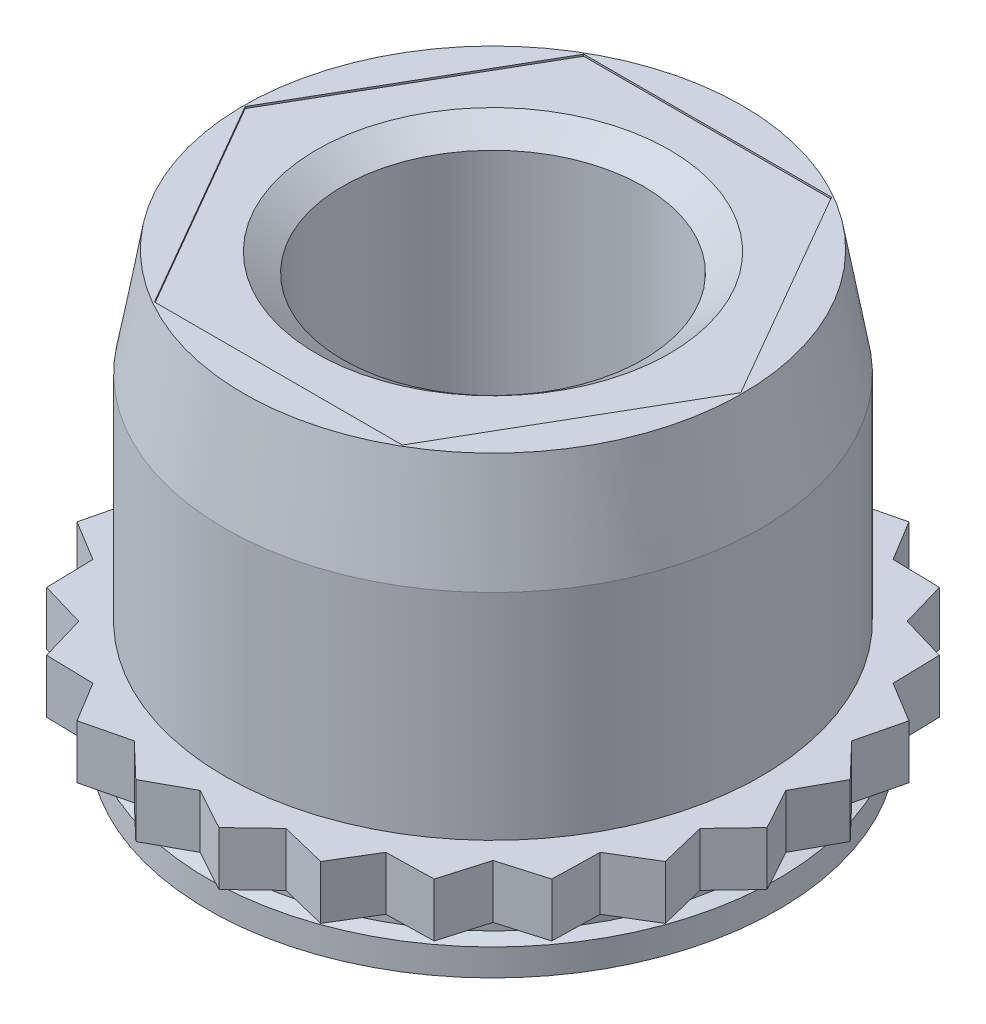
ISO-10303-21;
HEADER;
FILE_DESCRIPTION(('STEP AP214'),'2;1');
FILE_NAME('part.step','',(''),(''),'','','');
FILE_SCHEMA(('AUTOMOTIVE_DESIGN { 1 0 10303 214 1 1 1 1 }'));
ENDSEC;
DATA;
#1=APPLICATION_CONTEXT('core data for automotive mechanical design processes');
#2=APPLICATION_PROTOCOL_DEFINITION('international standard','automotive_design',2000,#1);
#3=PRODUCT_CONTEXT('',#1,'mechanical');
#4=PRODUCT('Part','Part','',(#3));
#5=PRODUCT_RELATED_PRODUCT_CATEGORY('part','',(#4));
#6=PRODUCT_DEFINITION_FORMATION('','',#4);
#7=PRODUCT_DEFINITION_CONTEXT('part definition',#1,'design');
#8=PRODUCT_DEFINITION('design','',#6,#7);
#9=PRODUCT_DEFINITION_SHAPE('','',#8);
#10=(LENGTH_UNIT() NAMED_UNIT(*) SI_UNIT(.MILLI.,.METRE.));
#11=(NAMED_UNIT(*) PLANE_ANGLE_UNIT() SI_UNIT($,.RADIAN.));
#12=(NAMED_UNIT(*) SI_UNIT($,.STERADIAN.) SOLID_ANGLE_UNIT());
#13=UNCERTAINTY_MEASURE_WITH_UNIT(LENGTH_MEASURE(1.E-05),#10,'distance_accuracy_value','');
#14=(GEOMETRIC_REPRESENTATION_CONTEXT(3) GLOBAL_UNCERTAINTY_ASSIGNED_CONTEXT((#13)) GLOBAL_UNIT_ASSIGNED_CONTEXT((#10,
#11,#12)) REPRESENTATION_CONTEXT('',''));
#15=CARTESIAN_POINT('',(0.,0.,0.));
#16=DIRECTION('',(0.,0.,1.));
#17=DIRECTION('',(1.,0.,0.));
#18=AXIS2_PLACEMENT_3D('',#15,#16,#17);
#19=CARTESIAN_POINT('',(0.,0.,0.));
#20=DIRECTION('',(0.,-1.,0.));
#21=DIRECTION('',(0.,0.,-1.));
#22=AXIS2_PLACEMENT_3D('',#19,#20,#21);
#23=CYLINDRICAL_SURFACE('',#22,3.75);
#24=CARTESIAN_POINT('',(0.,3.,0.));
#25=DIRECTION('',(0.,-1.,0.));
#26=DIRECTION('',(0.,0.,-1.));
#27=AXIS2_PLACEMENT_3D('',#24,#25,#26);
#28=CIRCLE('',#27,3.75);
#29=CARTESIAN_POINT('',(0.,3.,-3.75));
#30=VERTEX_POINT('',#29);
#31=EDGE_CURVE('E11',#30,#30,#28,.T.);
#32=ORIENTED_EDGE('',*,*,#31,.T.);
#33=EDGE_LOOP('',(#32));
#34=FACE_BOUND('',#33,.T.);
#35=CARTESIAN_POINT('',(0.,0.,0.));
#36=DIRECTION('',(0.,-1.,0.));
#37=DIRECTION('',(0.,0.,-1.));
#38=AXIS2_PLACEMENT_3D('',#35,#36,#37);
#39=CIRCLE('',#38,3.75);
#40=CARTESIAN_POINT('',(0.,0.,-3.75));
#41=VERTEX_POINT('',#40);
#42=EDGE_CURVE('E825',#41,#41,#39,.T.);
#43=ORIENTED_EDGE('',*,*,#42,.F.);
#44=EDGE_LOOP('',(#43));
#45=FACE_BOUND('',#44,.T.);
#46=ADVANCED_FACE('F35',(#34,#45),#23,.T.);
#47=CARTESIAN_POINT('',(0.,3.,0.));
#48=DIRECTION('',(0.,-1.,0.));
#49=DIRECTION('',(0.,0.,-1.));
#50=AXIS2_PLACEMENT_3D('',#47,#48,#49);
#51=CONICAL_SURFACE('',#50,3.75,0.174532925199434);
#52=CARTESIAN_POINT('',(0.,4.5,0.));
#53=DIRECTION('',(0.,-1.,0.));
#54=DIRECTION('',(0.,0.,-1.));
#55=AXIS2_PLACEMENT_3D('',#52,#53,#54);
#56=CIRCLE('',#55,3.4855095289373);
#57=CARTESIAN_POINT('',(0.,4.5,-3.4855095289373));
#58=VERTEX_POINT('',#57);
#59=EDGE_CURVE('E43',#58,#58,#56,.T.);
#60=ORIENTED_EDGE('',*,*,#59,.T.);
#61=EDGE_LOOP('',(#60));
#62=FACE_BOUND('',#61,.T.);
#63=ORIENTED_EDGE('',*,*,#31,.F.);
#64=EDGE_LOOP('',(#63));
#65=FACE_BOUND('',#64,.T.);
#66=ADVANCED_FACE('F866',(#62,#65),#51,.T.);
#67=CARTESIAN_POINT('',(3.4855095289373,4.5,0.));
#68=DIRECTION('',(0.,1.,0.));
#69=DIRECTION('',(0.,0.,1.));
#70=AXIS2_PLACEMENT_3D('',#67,#68,#69);
#71=PLANE('',#70);
#72=DIRECTION('',(0.5,0.,-0.866025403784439));
#73=VECTOR('',#72,1.);
#74=CARTESIAN_POINT('',(3.46410161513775,4.5,0.));
#75=LINE('',#74,#73);
#76=CARTESIAN_POINT('',(1.73205080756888,4.5,3.));
#77=VERTEX_POINT('',#76);
#78=CARTESIAN_POINT('',(3.46410161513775,4.5,0.));
#79=VERTEX_POINT('',#78);
#80=EDGE_CURVE('E51',#77,#79,#75,.T.);
#81=ORIENTED_EDGE('',*,*,#80,.F.);
#82=DIRECTION('',(1.,0.,0.));
#83=VECTOR('',#82,1.);
#84=CARTESIAN_POINT('',(1.73205080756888,4.5,3.));
#85=LINE('',#84,#83);
#86=CARTESIAN_POINT('',(-1.73205080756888,4.5,3.));
#87=VERTEX_POINT('',#86);
#88=EDGE_CURVE('E400',#87,#77,#85,.T.);
#89=ORIENTED_EDGE('',*,*,#88,.F.);
#90=DIRECTION('',(0.5,0.,0.866025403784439));
#91=VECTOR('',#90,1.);
#92=CARTESIAN_POINT('',(-1.73205080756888,4.5,3.));
#93=LINE('',#92,#91);
#94=CARTESIAN_POINT('',(-3.46410161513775,4.5,0.));
#95=VERTEX_POINT('',#94);
#96=EDGE_CURVE('E403',#95,#87,#93,.T.);
#97=ORIENTED_EDGE('',*,*,#96,.F.);
#98=DIRECTION('',(-0.5,0.,0.866025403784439));
#99=VECTOR('',#98,1.);
#100=CARTESIAN_POINT('',(-3.46410161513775,4.5,0.));
#101=LINE('',#100,#99);
#102=CARTESIAN_POINT('',(-1.73205080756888,4.5,-3.));
#103=VERTEX_POINT('',#102);
#104=EDGE_CURVE('E419',#103,#95,#101,.T.);
#105=ORIENTED_EDGE('',*,*,#104,.F.);
#106=DIRECTION('',(-1.,0.,0.));
#107=VECTOR('',#106,1.);
#108=CARTESIAN_POINT('',(-1.73205080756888,4.5,-3.));
#109=LINE('',#108,#107);
#110=CARTESIAN_POINT('',(1.73205080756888,4.5,-3.));
#111=VERTEX_POINT('',#110);
#112=EDGE_CURVE('E416',#111,#103,#109,.T.);
#113=ORIENTED_EDGE('',*,*,#112,.F.);
#114=DIRECTION('',(-0.5,0.,-0.866025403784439));
#115=VECTOR('',#114,1.);
#116=CARTESIAN_POINT('',(1.73205080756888,4.5,-3.));
#117=LINE('',#116,#115);
#118=EDGE_CURVE('E414',#79,#111,#117,.T.);
#119=ORIENTED_EDGE('',*,*,#118,.F.);
#120=EDGE_LOOP('',(#81,#89,#97,#105,#113,#119));
#121=FACE_BOUND('',#120,.T.);
#122=ORIENTED_EDGE('',*,*,#59,.F.);
#123=EDGE_LOOP('',(#122));
#124=FACE_BOUND('',#123,.T.);
#125=ADVANCED_FACE('F871',(#121,#124),#71,.T.);
#126=CARTESIAN_POINT('',(0.,0.,0.));
#127=DIRECTION('',(0.,-1.,0.));
#128=DIRECTION('',(0.,0.,-1.));
#129=AXIS2_PLACEMENT_3D('',#126,#127,#128);
#130=CYLINDRICAL_SURFACE('',#129,2.1);
#131=CARTESIAN_POINT('',(0.,4.21748101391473,0.));
#132=DIRECTION('',(0.,-1.,0.));
#133=DIRECTION('',(0.,0.,-1.));
#134=AXIS2_PLACEMENT_3D('',#131,#132,#133);
#135=CIRCLE('',#134,2.1);
#136=CARTESIAN_POINT('',(0.,4.21748101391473,-2.1));
#137=VERTEX_POINT('',#136);
#138=EDGE_CURVE('E811',#137,#137,#135,.T.);
#139=ORIENTED_EDGE('',*,*,#138,.F.);
#140=EDGE_LOOP('',(#139));
#141=FACE_BOUND('',#140,.T.);
#142=CARTESIAN_POINT('',(0.,-1.21748101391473,0.));
#143=DIRECTION('',(0.,-1.,0.));
#144=DIRECTION('',(0.,0.,-1.));
#145=AXIS2_PLACEMENT_3D('',#142,#143,#144);
#146=CIRCLE('',#145,2.1);
#147=CARTESIAN_POINT('',(0.,-1.21748101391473,-2.1));
#148=VERTEX_POINT('',#147);
#149=EDGE_CURVE('E821',#148,#148,#146,.T.);
#150=ORIENTED_EDGE('',*,*,#149,.T.);
#151=EDGE_LOOP('',(#150));
#152=FACE_BOUND('',#151,.T.);
#153=ADVANCED_FACE('F851',(#141,#152),#130,.F.);
#154=CARTESIAN_POINT('',(2.1,-1.5,0.));
#155=DIRECTION('',(0.,-1.,0.));
#156=DIRECTION('',(0.,0.,-1.));
#157=AXIS2_PLACEMENT_3D('',#154,#155,#156);
#158=PLANE('',#157);
#159=CARTESIAN_POINT('',(0.,-1.5,0.));
#160=DIRECTION('',(0.,-1.,0.));
#161=DIRECTION('',(0.,0.,-1.));
#162=AXIS2_PLACEMENT_3D('',#159,#160,#161);
#163=CIRCLE('',#162,2.5);
#164=CARTESIAN_POINT('',(0.,-1.5,-2.5));
#165=VERTEX_POINT('',#164);
#166=EDGE_CURVE('E824',#165,#165,#163,.T.);
#167=ORIENTED_EDGE('',*,*,#166,.F.);
#168=EDGE_LOOP('',(#167));
#169=FACE_BOUND('',#168,.T.);
#170=CARTESIAN_POINT('',(0.,-1.5,0.));
#171=DIRECTION('',(0.,-1.,0.));
#172=DIRECTION('',(0.,0.,-1.));
#173=AXIS2_PLACEMENT_3D('',#170,#171,#172);
#174=CIRCLE('',#173,3.985);
#175=CARTESIAN_POINT('',(0.,-1.5,-3.985));
#176=VERTEX_POINT('',#175);
#177=EDGE_CURVE('E837',#176,#176,#174,.T.);
#178=ORIENTED_EDGE('',*,*,#177,.T.);
#179=EDGE_LOOP('',(#178));
#180=FACE_BOUND('',#179,.T.);
#181=ADVANCED_FACE('F847',(#169,#180),#158,.T.);
#182=CARTESIAN_POINT('',(0.,0.,0.));
#183=DIRECTION('',(0.,-1.,0.));
#184=DIRECTION('',(0.,0.,-1.));
#185=AXIS2_PLACEMENT_3D('',#182,#183,#184);
#186=CYLINDRICAL_SURFACE('',#185,3.985);
#187=CARTESIAN_POINT('',(0.,-1.125,0.));
#188=DIRECTION('',(0.,-1.,0.));
#189=DIRECTION('',(0.,0.,-1.));
#190=AXIS2_PLACEMENT_3D('',#187,#188,#189);
#191=CIRCLE('',#190,3.985);
#192=CARTESIAN_POINT('',(0.,-1.125,-3.985));
#193=VERTEX_POINT('',#192);
#194=EDGE_CURVE('E834',#193,#193,#191,.T.);
#195=ORIENTED_EDGE('',*,*,#194,.T.);
#196=EDGE_LOOP('',(#195));
#197=FACE_BOUND('',#196,.T.);
#198=ORIENTED_EDGE('',*,*,#177,.F.);
#199=EDGE_LOOP('',(#198));
#200=FACE_BOUND('',#199,.T.);
#201=ADVANCED_FACE('F850',(#197,#200),#186,.T.);
#202=CARTESIAN_POINT('',(0.,-1.125,0.));
#203=DIRECTION('',(0.,-1.,0.));
#204=DIRECTION('',(0.,0.,-1.));
#205=AXIS2_PLACEMENT_3D('',#202,#203,#204);
#206=CONICAL_SURFACE('',#205,3.985,1.30899693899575);
#207=CARTESIAN_POINT('',(0.,-1.0716111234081,0.));
#208=DIRECTION('',(0.,-1.,0.));
#209=DIRECTION('',(0.,0.,-1.));
#210=AXIS2_PLACEMENT_3D('',#207,#208,#209);
#211=CIRCLE('',#210,3.78575);
#212=CARTESIAN_POINT('',(0.,-1.0716111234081,-3.78575));
#213=VERTEX_POINT('',#212);
#214=EDGE_CURVE('E831',#213,#213,#211,.T.);
#215=ORIENTED_EDGE('',*,*,#214,.T.);
#216=EDGE_LOOP('',(#215));
#217=FACE_BOUND('',#216,.T.);
#218=ORIENTED_EDGE('',*,*,#194,.F.);
#219=EDGE_LOOP('',(#218));
#220=FACE_BOUND('',#219,.T.);
#221=ADVANCED_FACE('F856',(#217,#220),#206,.T.);
#222=CARTESIAN_POINT('',(0.,0.,0.));
#223=DIRECTION('',(0.,-1.,0.));
#224=DIRECTION('',(0.,0.,-1.));
#225=AXIS2_PLACEMENT_3D('',#222,#223,#224);
#226=CYLINDRICAL_SURFACE('',#225,3.78575);
#227=CARTESIAN_POINT('',(0.,-0.75,0.));
#228=DIRECTION('',(0.,-1.,0.));
#229=DIRECTION('',(0.,0.,-1.));
#230=AXIS2_PLACEMENT_3D('',#227,#228,#229);
#231=CIRCLE('',#230,3.78575);
#232=CARTESIAN_POINT('',(0.,-0.75,-3.78575));
#233=VERTEX_POINT('',#232);
#234=EDGE_CURVE('E828',#233,#233,#231,.T.);
#235=ORIENTED_EDGE('',*,*,#234,.T.);
#236=EDGE_LOOP('',(#235));
#237=FACE_BOUND('',#236,.T.);
#238=ORIENTED_EDGE('',*,*,#214,.F.);
#239=EDGE_LOOP('',(#238));
#240=FACE_BOUND('',#239,.T.);
#241=ADVANCED_FACE('F862',(#237,#240),#226,.T.);
#242=CARTESIAN_POINT('',(3.78575,-0.75,0.));
#243=DIRECTION('',(0.,-1.,0.));
#244=DIRECTION('',(0.,0.,-1.));
#245=AXIS2_PLACEMENT_3D('',#242,#243,#244);
#246=PLANE('',#245);
#247=DIRECTION('',(0.723032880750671,0.,0.690813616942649));
#248=VECTOR('',#247,1.);
#249=CARTESIAN_POINT('',(-0.580841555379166,-0.75,4.41192963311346));
#250=LINE('',#249,#248);
#251=CARTESIAN_POINT('',(-1.05960517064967,-0.75,3.95450033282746));
#252=VERTEX_POINT('',#251);
#253=CARTESIAN_POINT('',(-0.580841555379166,-0.75,4.41192963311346));
#254=VERTEX_POINT('',#253);
#255=EDGE_CURVE('E437',#252,#254,#250,.T.);
#256=ORIENTED_EDGE('',*,*,#255,.F.);
#257=DIRECTION('',(0.971571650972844,0.,-0.236745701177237));
#258=VECTOR('',#257,1.);
#259=CARTESIAN_POINT('',(-1.05960517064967,-0.75,3.95450033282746));
#260=LINE('',#259,#258);
#261=CARTESIAN_POINT('',(-1.7029412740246,-0.75,4.11126391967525));
#262=VERTEX_POINT('',#261);
#263=EDGE_CURVE('E441',#262,#252,#260,.T.);
#264=ORIENTED_EDGE('',*,*,#263,.F.);
#265=DIRECTION('',(0.519600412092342,0.,0.854409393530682));
#266=VECTOR('',#265,1.);
#267=CARTESIAN_POINT('',(-1.70294127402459,-0.75,4.11126391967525));
#268=LINE('',#267,#266);
#269=CARTESIAN_POINT('',(-2.04699999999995,-0.75,3.54550800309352));
#270=VERTEX_POINT('',#269);
#271=EDGE_CURVE('E451',#270,#262,#268,.T.);
#272=ORIENTED_EDGE('',*,*,#271,.F.);
#273=DIRECTION('',(0.999740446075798,0.,0.0227824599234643));
#274=VECTOR('',#273,1.);
#275=CARTESIAN_POINT('',(-2.04699999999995,-0.75,3.54550800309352));
#276=LINE('',#275,#274);
#277=CARTESIAN_POINT('',(-2.70898835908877,-0.75,3.53042236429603));
#278=VERTEX_POINT('',#277);
#279=EDGE_CURVE('E446',#278,#270,#276,.T.);
#280=ORIENTED_EDGE('',*,*,#279,.F.);
#281=DIRECTION('',(0.2807580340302,0.,0.959778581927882));
#282=VECTOR('',#281,1.);
#283=CARTESIAN_POINT('',(-2.70898835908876,-0.75,3.53042236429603));
#284=LINE('',#283,#282);
#285=CARTESIAN_POINT('',(-2.89489516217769,-0.75,2.89489516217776));
#286=VERTEX_POINT('',#285);
#287=EDGE_CURVE('E467',#286,#278,#284,.T.);
#288=ORIENTED_EDGE('',*,*,#287,.F.);
#289=DIRECTION('',(0.959778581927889,0.,0.280758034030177));
#290=VECTOR('',#289,1.);
#291=CARTESIAN_POINT('',(-2.89489516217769,-0.75,2.89489516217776));
#292=LINE('',#291,#290);
#293=CARTESIAN_POINT('',(-3.53042236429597,-0.75,2.70898835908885));
#294=VERTEX_POINT('',#293);
#295=EDGE_CURVE('E461',#294,#286,#292,.T.);
#296=ORIENTED_EDGE('',*,*,#295,.F.);
#297=DIRECTION('',(0.0227824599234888,0.,0.999740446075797));
#298=VECTOR('',#297,1.);
#299=CARTESIAN_POINT('',(-3.53042236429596,-0.75,2.70898835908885));
#300=LINE('',#299,#298);
#301=CARTESIAN_POINT('',(-3.54550800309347,-0.75,2.04700000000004));
#302=VERTEX_POINT('',#301);
#303=EDGE_CURVE('E483',#302,#294,#300,.T.);
#304=ORIENTED_EDGE('',*,*,#303,.F.);
#305=DIRECTION('',(0.854409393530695,0.,0.519600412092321));
#306=VECTOR('',#305,1.);
#307=CARTESIAN_POINT('',(-3.54550800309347,-0.75,2.04700000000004));
#308=LINE('',#307,#306);
#309=CARTESIAN_POINT('',(-4.11126391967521,-0.75,1.70294127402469));
#310=VERTEX_POINT('',#309);
#311=EDGE_CURVE('E477',#310,#302,#308,.T.);
#312=ORIENTED_EDGE('',*,*,#311,.F.);
#313=DIRECTION('',(-0.236745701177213,0.,0.97157165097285));
#314=VECTOR('',#313,1.);
#315=CARTESIAN_POINT('',(-4.11126391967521,-0.75,1.7029412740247));
#316=LINE('',#315,#314);
#317=CARTESIAN_POINT('',(-3.95450033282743,-0.75,1.05960517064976));
#318=VERTEX_POINT('',#317);
#319=EDGE_CURVE('E499',#318,#310,#316,.T.);
#320=ORIENTED_EDGE('',*,*,#319,.F.);
#321=DIRECTION('',(0.690813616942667,0.,0.723032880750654));
#322=VECTOR('',#321,1.);
#323=CARTESIAN_POINT('',(-3.95450033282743,-0.75,1.05960517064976));
#324=LINE('',#323,#322);
#325=CARTESIAN_POINT('',(-4.41192963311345,-0.75,0.580841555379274));
#326=VERTEX_POINT('',#325);
#327=EDGE_CURVE('E493',#326,#318,#324,.T.);
#328=ORIENTED_EDGE('',*,*,#327,.F.);
#329=DIRECTION('',(-0.480140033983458,0.,0.877191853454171));
#330=VECTOR('',#329,1.);
#331=CARTESIAN_POINT('',(-4.41192963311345,-0.75,0.58084155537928));
#332=LINE('',#331,#330);
#333=CARTESIAN_POINT('',(-4.094,-0.75,0.));
#334=VERTEX_POINT('',#333);
#335=EDGE_CURVE('E515',#334,#326,#332,.T.);
#336=ORIENTED_EDGE('',*,*,#335,.F.);
#337=DIRECTION('',(0.480140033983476,0.,0.877191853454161));
#338=VECTOR('',#337,1.);
#339=CARTESIAN_POINT('',(-4.094,-0.75,0.));
#340=LINE('',#339,#338);
#341=CARTESIAN_POINT('',(-4.41192963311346,-0.75,-0.580841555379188));
#342=VERTEX_POINT('',#341);
#343=EDGE_CURVE('E509',#342,#334,#340,.T.);
#344=ORIENTED_EDGE('',*,*,#343,.F.);
#345=DIRECTION('',(-0.690813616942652,0.,0.723032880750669));
#346=VECTOR('',#345,1.);
#347=CARTESIAN_POINT('',(-4.41192963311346,-0.75,-0.580841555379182));
#348=LINE('',#347,#346);
#349=CARTESIAN_POINT('',(-3.95450033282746,-0.75,-1.05960517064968));
#350=VERTEX_POINT('',#349);
#351=EDGE_CURVE('E531',#350,#342,#348,.T.);
#352=ORIENTED_EDGE('',*,*,#351,.F.);
#353=DIRECTION('',(0.236745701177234,0.,0.971571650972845));
#354=VECTOR('',#353,1.);
#355=CARTESIAN_POINT('',(-3.95450033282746,-0.75,-1.05960517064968));
#356=LINE('',#355,#354);
#357=CARTESIAN_POINT('',(-4.11126391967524,-0.75,-1.70294127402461));
#358=VERTEX_POINT('',#357);
#359=EDGE_CURVE('E525',#358,#350,#356,.T.);
#360=ORIENTED_EDGE('',*,*,#359,.F.);
#361=DIRECTION('',(-0.854409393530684,0.,0.519600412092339));
#362=VECTOR('',#361,1.);
#363=CARTESIAN_POINT('',(-4.11126391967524,-0.75,-1.70294127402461));
#364=LINE('',#363,#362);
#365=CARTESIAN_POINT('',(-3.54550800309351,-0.75,-2.04699999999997));
#366=VERTEX_POINT('',#365);
#367=EDGE_CURVE('E547',#366,#358,#364,.T.);
#368=ORIENTED_EDGE('',*,*,#367,.F.);
#369=DIRECTION('',(-0.0227824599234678,0.,0.999740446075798));
#370=VECTOR('',#369,1.);
#371=CARTESIAN_POINT('',(-3.54550800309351,-0.75,-2.04699999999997));
#372=LINE('',#371,#370);
#373=CARTESIAN_POINT('',(-3.53042236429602,-0.75,-2.70898835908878));
#374=VERTEX_POINT('',#373);
#375=EDGE_CURVE('E541',#374,#366,#372,.T.);
#376=ORIENTED_EDGE('',*,*,#375,.F.);
#377=DIRECTION('',(-0.959778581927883,0.,0.280758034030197));
#378=VECTOR('',#377,1.);
#379=CARTESIAN_POINT('',(-3.53042236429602,-0.75,-2.70898835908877));
#380=LINE('',#379,#378);
#381=CARTESIAN_POINT('',(-2.89489516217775,-0.75,-2.8948951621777));
#382=VERTEX_POINT('',#381);
#383=EDGE_CURVE('E563',#382,#374,#380,.T.);
#384=ORIENTED_EDGE('',*,*,#383,.F.);
#385=DIRECTION('',(-0.28075803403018,0.,0.959778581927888));
#386=VECTOR('',#385,1.);
#387=CARTESIAN_POINT('',(-2.89489516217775,-0.75,-2.8948951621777));
#388=LINE('',#387,#386);
#389=CARTESIAN_POINT('',(-2.70898835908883,-0.75,-3.53042236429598));
#390=VERTEX_POINT('',#389);
#391=EDGE_CURVE('E557',#390,#382,#388,.T.);
#392=ORIENTED_EDGE('',*,*,#391,.F.);
#393=DIRECTION('',(-0.999740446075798,0.,0.0227824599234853));
#394=VECTOR('',#393,1.);
#395=CARTESIAN_POINT('',(-2.70898835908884,-0.75,-3.53042236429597));
#396=LINE('',#395,#394);
#397=CARTESIAN_POINT('',(-2.04700000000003,-0.75,-3.54550800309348));
#398=VERTEX_POINT('',#397);
#399=EDGE_CURVE('E579',#398,#390,#396,.T.);
#400=ORIENTED_EDGE('',*,*,#399,.F.);
#401=DIRECTION('',(-0.519600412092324,0.,0.854409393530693));
#402=VECTOR('',#401,1.);
#403=CARTESIAN_POINT('',(-2.04700000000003,-0.75,-3.54550800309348));
#404=LINE('',#403,#402);
#405=CARTESIAN_POINT('',(-1.70294127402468,-0.75,-4.11126391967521));
#406=VERTEX_POINT('',#405);
#407=EDGE_CURVE('E573',#406,#398,#404,.T.);
#408=ORIENTED_EDGE('',*,*,#407,.F.);
#409=DIRECTION('',(-0.971571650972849,0.,-0.236745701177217));
#410=VECTOR('',#409,1.);
#411=CARTESIAN_POINT('',(-1.70294127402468,-0.75,-4.11126391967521));
#412=LINE('',#411,#410);
#413=CARTESIAN_POINT('',(-1.05960517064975,-0.75,-3.95450033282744));
#414=VERTEX_POINT('',#413);
#415=EDGE_CURVE('E595',#414,#406,#412,.T.);
#416=ORIENTED_EDGE('',*,*,#415,.F.);
#417=DIRECTION('',(-0.723032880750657,0.,0.690813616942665));
#418=VECTOR('',#417,1.);
#419=CARTESIAN_POINT('',(-1.05960517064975,-0.75,-3.95450033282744));
#420=LINE('',#419,#418);
#421=CARTESIAN_POINT('',(-0.580841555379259,-0.75,-4.41192963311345));
#422=VERTEX_POINT('',#421);
#423=EDGE_CURVE('E589',#422,#414,#420,.T.);
#424=ORIENTED_EDGE('',*,*,#423,.F.);
#425=DIRECTION('',(-0.877191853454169,0.,-0.480140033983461));
#426=VECTOR('',#425,1.);
#427=CARTESIAN_POINT('',(-0.580841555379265,-0.75,-4.41192963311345));
#428=LINE('',#427,#426);
#429=CARTESIAN_POINT('',(0.,-0.75,-4.094));
#430=VERTEX_POINT('',#429);
#431=EDGE_CURVE('E611',#430,#422,#428,.T.);
#432=ORIENTED_EDGE('',*,*,#431,.F.);
#433=DIRECTION('',(-0.877191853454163,0.,0.480140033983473));
#434=VECTOR('',#433,1.);
#435=CARTESIAN_POINT('',(0.,-0.75,-4.094));
#436=LINE('',#435,#434);
#437=CARTESIAN_POINT('',(0.580841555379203,-0.75,-4.41192963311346));
#438=VERTEX_POINT('',#437);
#439=EDGE_CURVE('E605',#438,#430,#436,.T.);
#440=ORIENTED_EDGE('',*,*,#439,.F.);
#441=DIRECTION('',(-0.723032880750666,0.,-0.690813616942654));
#442=VECTOR('',#441,1.);
#443=CARTESIAN_POINT('',(0.580841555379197,-0.75,-4.41192963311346));
#444=LINE('',#443,#442);
#445=CARTESIAN_POINT('',(1.05960517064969,-0.75,-3.95450033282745));
#446=VERTEX_POINT('',#445);
#447=EDGE_CURVE('E627',#446,#438,#444,.T.);
#448=ORIENTED_EDGE('',*,*,#447,.F.);
#449=DIRECTION('',(-0.971571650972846,0.,0.23674570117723));
#450=VECTOR('',#449,1.);
#451=CARTESIAN_POINT('',(1.05960517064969,-0.75,-3.95450033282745));
#452=LINE('',#451,#450);
#453=CARTESIAN_POINT('',(1.70294127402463,-0.75,-4.11126391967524));
#454=VERTEX_POINT('',#453);
#455=EDGE_CURVE('E621',#454,#446,#452,.T.);
#456=ORIENTED_EDGE('',*,*,#455,.F.);
#457=DIRECTION('',(-0.519600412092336,0.,-0.854409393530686));
#458=VECTOR('',#457,1.);
#459=CARTESIAN_POINT('',(1.70294127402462,-0.75,-4.11126391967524));
#460=LINE('',#459,#458);
#461=CARTESIAN_POINT('',(2.04699999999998,-0.75,-3.5455080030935));
#462=VERTEX_POINT('',#461);
#463=EDGE_CURVE('E643',#462,#454,#460,.T.);
#464=ORIENTED_EDGE('',*,*,#463,.F.);
#465=DIRECTION('',(-0.999740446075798,0.,-0.0227824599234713));
#466=VECTOR('',#465,1.);
#467=CARTESIAN_POINT('',(2.04699999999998,-0.75,-3.5455080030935));
#468=LINE('',#467,#466);
#469=CARTESIAN_POINT('',(2.70898835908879,-0.75,-3.53042236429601));
#470=VERTEX_POINT('',#469);
#471=EDGE_CURVE('E637',#470,#462,#468,.T.);
#472=ORIENTED_EDGE('',*,*,#471,.F.);
#473=DIRECTION('',(-0.280758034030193,0.,-0.959778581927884));
#474=VECTOR('',#473,1.);
#475=CARTESIAN_POINT('',(2.70898835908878,-0.75,-3.53042236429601));
#476=LINE('',#475,#474);
#477=CARTESIAN_POINT('',(2.89489516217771,-0.75,-2.89489516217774));
#478=VERTEX_POINT('',#477);
#479=EDGE_CURVE('E659',#478,#470,#476,.T.);
#480=ORIENTED_EDGE('',*,*,#479,.F.);
#481=DIRECTION('',(-0.959778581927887,0.,-0.280758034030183));
#482=VECTOR('',#481,1.);
#483=CARTESIAN_POINT('',(2.89489516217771,-0.75,-2.89489516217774));
#484=LINE('',#483,#482);
#485=CARTESIAN_POINT('',(3.53042236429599,-0.75,-2.70898835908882));
#486=VERTEX_POINT('',#485);
#487=EDGE_CURVE('E653',#486,#478,#484,.T.);
#488=ORIENTED_EDGE('',*,*,#487,.F.);
#489=DIRECTION('',(-0.0227824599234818,0.,-0.999740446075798));
#490=VECTOR('',#489,1.);
#491=CARTESIAN_POINT('',(3.53042236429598,-0.75,-2.70898835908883));
#492=LINE('',#491,#490);
#493=CARTESIAN_POINT('',(3.54550800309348,-0.75,-2.04700000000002));
#494=VERTEX_POINT('',#493);
#495=EDGE_CURVE('E675',#494,#486,#492,.T.);
#496=ORIENTED_EDGE('',*,*,#495,.F.);
#497=DIRECTION('',(-0.854409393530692,0.,-0.519600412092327));
#498=VECTOR('',#497,1.);
#499=CARTESIAN_POINT('',(3.54550800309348,-0.75,-2.04700000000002));
#500=LINE('',#499,#498);
#501=CARTESIAN_POINT('',(4.11126391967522,-0.75,-1.70294127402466));
#502=VERTEX_POINT('',#501);
#503=EDGE_CURVE('E669',#502,#494,#500,.T.);
#504=ORIENTED_EDGE('',*,*,#503,.F.);
#505=DIRECTION('',(0.23674570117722,0.,-0.971571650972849));
#506=VECTOR('',#505,1.);
#507=CARTESIAN_POINT('',(4.11126391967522,-0.75,-1.70294127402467));
#508=LINE('',#507,#506);
#509=CARTESIAN_POINT('',(3.95450033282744,-0.75,-1.05960517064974));
#510=VERTEX_POINT('',#509);
#511=EDGE_CURVE('E691',#510,#502,#508,.T.);
#512=ORIENTED_EDGE('',*,*,#511,.F.);
#513=DIRECTION('',(-0.690813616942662,0.,-0.723032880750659));
#514=VECTOR('',#513,1.);
#515=CARTESIAN_POINT('',(3.95450033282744,-0.75,-1.05960517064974));
#516=LINE('',#515,#514);
#517=CARTESIAN_POINT('',(4.41192963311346,-0.75,-0.580841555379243));
#518=VERTEX_POINT('',#517);
#519=EDGE_CURVE('E685',#518,#510,#516,.T.);
#520=ORIENTED_EDGE('',*,*,#519,.F.);
#521=DIRECTION('',(0.480140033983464,0.,-0.877191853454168));
#522=VECTOR('',#521,1.);
#523=CARTESIAN_POINT('',(4.41192963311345,-0.75,-0.580841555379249));
#524=LINE('',#523,#522);
#525=CARTESIAN_POINT('',(4.094,-0.75,0.));
#526=VERTEX_POINT('',#525);
#527=EDGE_CURVE('E707',#526,#518,#524,.T.);
#528=ORIENTED_EDGE('',*,*,#527,.F.);
#529=DIRECTION('',(-0.48014003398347,0.,-0.877191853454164));
#530=VECTOR('',#529,1.);
#531=CARTESIAN_POINT('',(4.094,-0.75,0.));
#532=LINE('',#531,#530);
#533=CARTESIAN_POINT('',(4.41192963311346,-0.75,0.580841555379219));
#534=VERTEX_POINT('',#533);
#535=EDGE_CURVE('E701',#534,#526,#532,.T.);
#536=ORIENTED_EDGE('',*,*,#535,.F.);
#537=DIRECTION('',(0.690813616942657,0.,-0.723032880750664));
#538=VECTOR('',#537,1.);
#539=CARTESIAN_POINT('',(4.41192963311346,-0.75,0.580841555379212));
#540=LINE('',#539,#538);
#541=CARTESIAN_POINT('',(3.95450033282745,-0.75,1.05960517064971));
#542=VERTEX_POINT('',#541);
#543=EDGE_CURVE('E723',#542,#534,#540,.T.);
#544=ORIENTED_EDGE('',*,*,#543,.F.);
#545=DIRECTION('',(-0.236745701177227,0.,-0.971571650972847));
#546=VECTOR('',#545,1.);
#547=CARTESIAN_POINT('',(3.95450033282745,-0.75,1.05960517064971));
#548=LINE('',#547,#546);
#549=CARTESIAN_POINT('',(4.11126391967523,-0.75,1.70294127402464));
#550=VERTEX_POINT('',#549);
#551=EDGE_CURVE('E717',#550,#542,#548,.T.);
#552=ORIENTED_EDGE('',*,*,#551,.F.);
#553=DIRECTION('',(0.854409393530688,0.,-0.519600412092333));
#554=VECTOR('',#553,1.);
#555=CARTESIAN_POINT('',(4.11126391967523,-0.75,1.70294127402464));
#556=LINE('',#555,#554);
#557=CARTESIAN_POINT('',(3.5455080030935,-0.75,2.04699999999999));
#558=VERTEX_POINT('',#557);
#559=EDGE_CURVE('E739',#558,#550,#556,.T.);
#560=ORIENTED_EDGE('',*,*,#559,.F.);
#561=DIRECTION('',(0.0227824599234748,0.,-0.999740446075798));
#562=VECTOR('',#561,1.);
#563=CARTESIAN_POINT('',(3.5455080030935,-0.75,2.04699999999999));
#564=LINE('',#563,#562);
#565=CARTESIAN_POINT('',(3.530422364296,-0.75,2.7089883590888));
#566=VERTEX_POINT('',#565);
#567=EDGE_CURVE('E733',#566,#558,#564,.T.);
#568=ORIENTED_EDGE('',*,*,#567,.F.);
#569=DIRECTION('',(0.959778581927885,0.,-0.28075803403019));
#570=VECTOR('',#569,1.);
#571=CARTESIAN_POINT('',(3.530422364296,-0.75,2.7089883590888));
#572=LINE('',#571,#570);
#573=CARTESIAN_POINT('',(2.89489516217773,-0.75,2.89489516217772));
#574=VERTEX_POINT('',#573);
#575=EDGE_CURVE('E755',#574,#566,#572,.T.);
#576=ORIENTED_EDGE('',*,*,#575,.F.);
#577=DIRECTION('',(0.280758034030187,0.,-0.959778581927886));
#578=VECTOR('',#577,1.);
#579=CARTESIAN_POINT('',(2.89489516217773,-0.75,2.89489516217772));
#580=LINE('',#579,#578);
#581=CARTESIAN_POINT('',(2.70898835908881,-0.75,3.53042236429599));
#582=VERTEX_POINT('',#581);
#583=EDGE_CURVE('E749',#582,#574,#580,.T.);
#584=ORIENTED_EDGE('',*,*,#583,.F.);
#585=DIRECTION('',(0.999740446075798,0.,-0.0227824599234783));
#586=VECTOR('',#585,1.);
#587=CARTESIAN_POINT('',(2.70898835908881,-0.75,3.53042236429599));
#588=LINE('',#587,#586);
#589=CARTESIAN_POINT('',(2.047,-0.75,3.54550800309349));
#590=VERTEX_POINT('',#589);
#591=EDGE_CURVE('E773',#590,#582,#588,.T.);
#592=ORIENTED_EDGE('',*,*,#591,.F.);
#593=DIRECTION('',(0.51960041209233,0.,-0.85440939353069));
#594=VECTOR('',#593,1.);
#595=CARTESIAN_POINT('',(2.047,-0.75,3.54550800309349));
#596=LINE('',#595,#594);
#597=CARTESIAN_POINT('',(1.70294127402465,-0.75,4.11126391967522));
#598=VERTEX_POINT('',#597);
#599=EDGE_CURVE('E769',#598,#590,#596,.T.);
#600=ORIENTED_EDGE('',*,*,#599,.F.);
#601=DIRECTION('',(0.971571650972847,0.,0.236745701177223));
#602=VECTOR('',#601,1.);
#603=CARTESIAN_POINT('',(1.70294127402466,-0.75,4.11126391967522));
#604=LINE('',#603,#602);
#605=CARTESIAN_POINT('',(1.05960517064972,-0.75,3.95450033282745));
#606=VERTEX_POINT('',#605);
#607=EDGE_CURVE('E787',#606,#598,#604,.T.);
#608=ORIENTED_EDGE('',*,*,#607,.F.);
#609=DIRECTION('',(0.723032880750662,0.,-0.69081361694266));
#610=VECTOR('',#609,1.);
#611=CARTESIAN_POINT('',(1.05960517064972,-0.75,3.95450033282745));
#612=LINE('',#611,#610);
#613=CARTESIAN_POINT('',(0.580841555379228,-0.75,4.41192963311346));
#614=VERTEX_POINT('',#613);
#615=EDGE_CURVE('E776',#614,#606,#612,.T.);
#616=ORIENTED_EDGE('',*,*,#615,.F.);
#617=DIRECTION('',(0.877191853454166,0.,0.480140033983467));
#618=VECTOR('',#617,1.);
#619=CARTESIAN_POINT('',(0.580841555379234,-0.75,4.41192963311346));
#620=LINE('',#619,#618);
#621=CARTESIAN_POINT('',(0.,-0.75,4.094));
#622=VERTEX_POINT('',#621);
#623=EDGE_CURVE('E802',#622,#614,#620,.T.);
#624=ORIENTED_EDGE('',*,*,#623,.F.);
#625=DIRECTION('',(0.877191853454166,0.,-0.480140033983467));
#626=VECTOR('',#625,1.);
#627=CARTESIAN_POINT('',(0.,-0.75,4.094));
#628=LINE('',#627,#626);
#629=EDGE_CURVE('E797',#254,#622,#628,.T.);
#630=ORIENTED_EDGE('',*,*,#629,.F.);
#631=EDGE_LOOP('',(#256,#264,#272,#280,#288,#296,#304,#312,#320,#328,#336,#344,#352,#360,#368,
#376,#384,#392,#400,#408,#416,#424,#432,#440,#448,#456,#464,#472,#480,#488,#496,#504,#512,#520,
#528,#536,#544,#552,#560,#568,#576,#584,#592,#600,#608,#616,#624,#630));
#632=FACE_BOUND('',#631,.T.);
#633=ORIENTED_EDGE('',*,*,#234,.F.);
#634=EDGE_LOOP('',(#633));
#635=FACE_BOUND('',#634,.T.);
#636=ADVANCED_FACE('F880',(#632,#635),#246,.T.);
#637=CARTESIAN_POINT('',(4.45,0.,0.));
#638=DIRECTION('',(0.,1.,0.));
#639=DIRECTION('',(0.,0.,1.));
#640=AXIS2_PLACEMENT_3D('',#637,#638,#639);
#641=PLANE('',#640);
#642=DIRECTION('',(0.723032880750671,0.,0.690813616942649));
#643=VECTOR('',#642,1.);
#644=CARTESIAN_POINT('',(-0.580841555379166,0.,4.41192963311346));
#645=LINE('',#644,#643);
#646=CARTESIAN_POINT('',(-1.05960517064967,0.,3.95450033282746));
#647=VERTEX_POINT('',#646);
#648=CARTESIAN_POINT('',(-0.580841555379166,0.,4.41192963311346));
#649=VERTEX_POINT('',#648);
#650=EDGE_CURVE('E436',#647,#649,#645,.T.);
#651=ORIENTED_EDGE('',*,*,#650,.T.);
#652=DIRECTION('',(0.877191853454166,0.,-0.480140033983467));
#653=VECTOR('',#652,1.);
#654=CARTESIAN_POINT('',(0.,0.,4.094));
#655=LINE('',#654,#653);
#656=CARTESIAN_POINT('',(0.,0.,4.094));
#657=VERTEX_POINT('',#656);
#658=EDGE_CURVE('E799',#649,#657,#655,.T.);
#659=ORIENTED_EDGE('',*,*,#658,.T.);
#660=DIRECTION('',(0.877191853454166,0.,0.480140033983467));
#661=VECTOR('',#660,1.);
#662=CARTESIAN_POINT('',(0.580841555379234,0.,4.41192963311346));
#663=LINE('',#662,#661);
#664=CARTESIAN_POINT('',(0.580841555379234,0.,4.41192963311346));
#665=VERTEX_POINT('',#664);
#666=EDGE_CURVE('E59',#657,#665,#663,.T.);
#667=ORIENTED_EDGE('',*,*,#666,.T.);
#668=DIRECTION('',(0.723032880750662,0.,-0.69081361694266));
#669=VECTOR('',#668,1.);
#670=CARTESIAN_POINT('',(1.05960517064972,0.,3.95450033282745));
#671=LINE('',#670,#669);
#672=CARTESIAN_POINT('',(1.05960517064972,0.,3.95450033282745));
#673=VERTEX_POINT('',#672);
#674=EDGE_CURVE('E783',#665,#673,#671,.T.);
#675=ORIENTED_EDGE('',*,*,#674,.T.);
#676=DIRECTION('',(0.971571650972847,0.,0.236745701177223));
#677=VECTOR('',#676,1.);
#678=CARTESIAN_POINT('',(1.70294127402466,0.,4.11126391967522));
#679=LINE('',#678,#677);
#680=CARTESIAN_POINT('',(1.70294127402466,0.,4.11126391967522));
#681=VERTEX_POINT('',#680);
#682=EDGE_CURVE('E786',#673,#681,#679,.T.);
#683=ORIENTED_EDGE('',*,*,#682,.T.);
#684=DIRECTION('',(0.51960041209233,0.,-0.85440939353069));
#685=VECTOR('',#684,1.);
#686=CARTESIAN_POINT('',(2.047,0.,3.54550800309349));
#687=LINE('',#686,#685);
#688=CARTESIAN_POINT('',(2.047,0.,3.54550800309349));
#689=VERTEX_POINT('',#688);
#690=EDGE_CURVE('E770',#681,#689,#687,.T.);
#691=ORIENTED_EDGE('',*,*,#690,.T.);
#692=DIRECTION('',(0.999740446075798,0.,-0.0227824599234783));
#693=VECTOR('',#692,1.);
#694=CARTESIAN_POINT('',(2.70898835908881,0.,3.53042236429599));
#695=LINE('',#694,#693);
#696=CARTESIAN_POINT('',(2.70898835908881,0.,3.53042236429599));
#697=VERTEX_POINT('',#696);
#698=EDGE_CURVE('E765',#689,#697,#695,.T.);
#699=ORIENTED_EDGE('',*,*,#698,.T.);
#700=DIRECTION('',(0.280758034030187,0.,-0.959778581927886));
#701=VECTOR('',#700,1.);
#702=CARTESIAN_POINT('',(2.89489516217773,0.,2.89489516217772));
#703=LINE('',#702,#701);
#704=CARTESIAN_POINT('',(2.89489516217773,0.,2.89489516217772));
#705=VERTEX_POINT('',#704);
#706=EDGE_CURVE('E751',#697,#705,#703,.T.);
#707=ORIENTED_EDGE('',*,*,#706,.T.);
#708=DIRECTION('',(0.959778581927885,0.,-0.28075803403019));
#709=VECTOR('',#708,1.);
#710=CARTESIAN_POINT('',(3.530422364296,0.,2.7089883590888));
#711=LINE('',#710,#709);
#712=CARTESIAN_POINT('',(3.530422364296,0.,2.7089883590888));
#713=VERTEX_POINT('',#712);
#714=EDGE_CURVE('E754',#705,#713,#711,.T.);
#715=ORIENTED_EDGE('',*,*,#714,.T.);
#716=DIRECTION('',(0.0227824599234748,0.,-0.999740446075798));
#717=VECTOR('',#716,1.);
#718=CARTESIAN_POINT('',(3.5455080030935,0.,2.04699999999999));
#719=LINE('',#718,#717);
#720=CARTESIAN_POINT('',(3.5455080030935,0.,2.04699999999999));
#721=VERTEX_POINT('',#720);
#722=EDGE_CURVE('E735',#713,#721,#719,.T.);
#723=ORIENTED_EDGE('',*,*,#722,.T.);
#724=DIRECTION('',(0.854409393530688,0.,-0.519600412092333));
#725=VECTOR('',#724,1.);
#726=CARTESIAN_POINT('',(4.11126391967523,0.,1.70294127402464));
#727=LINE('',#726,#725);
#728=CARTESIAN_POINT('',(4.11126391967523,0.,1.70294127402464));
#729=VERTEX_POINT('',#728);
#730=EDGE_CURVE('E738',#721,#729,#727,.T.);
#731=ORIENTED_EDGE('',*,*,#730,.T.);
#732=DIRECTION('',(-0.236745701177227,0.,-0.971571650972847));
#733=VECTOR('',#732,1.);
#734=CARTESIAN_POINT('',(3.95450033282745,0.,1.05960517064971));
#735=LINE('',#734,#733);
#736=CARTESIAN_POINT('',(3.95450033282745,0.,1.05960517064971));
#737=VERTEX_POINT('',#736);
#738=EDGE_CURVE('E719',#729,#737,#735,.T.);
#739=ORIENTED_EDGE('',*,*,#738,.T.);
#740=DIRECTION('',(0.690813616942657,0.,-0.723032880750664));
#741=VECTOR('',#740,1.);
#742=CARTESIAN_POINT('',(4.41192963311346,0.,0.580841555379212));
#743=LINE('',#742,#741);
#744=CARTESIAN_POINT('',(4.41192963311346,0.,0.580841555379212));
#745=VERTEX_POINT('',#744);
#746=EDGE_CURVE('E722',#737,#745,#743,.T.);
#747=ORIENTED_EDGE('',*,*,#746,.T.);
#748=DIRECTION('',(-0.48014003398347,0.,-0.877191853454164));
#749=VECTOR('',#748,1.);
#750=CARTESIAN_POINT('',(4.094,0.,0.));
#751=LINE('',#750,#749);
#752=CARTESIAN_POINT('',(4.094,0.,0.));
#753=VERTEX_POINT('',#752);
#754=EDGE_CURVE('E703',#745,#753,#751,.T.);
#755=ORIENTED_EDGE('',*,*,#754,.T.);
#756=DIRECTION('',(0.480140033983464,0.,-0.877191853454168));
#757=VECTOR('',#756,1.);
#758=CARTESIAN_POINT('',(4.41192963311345,0.,-0.580841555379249));
#759=LINE('',#758,#757);
#760=CARTESIAN_POINT('',(4.41192963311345,0.,-0.580841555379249));
#761=VERTEX_POINT('',#760);
#762=EDGE_CURVE('E706',#753,#761,#759,.T.);
#763=ORIENTED_EDGE('',*,*,#762,.T.);
#764=DIRECTION('',(-0.690813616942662,0.,-0.723032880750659));
#765=VECTOR('',#764,1.);
#766=CARTESIAN_POINT('',(3.95450033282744,0.,-1.05960517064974));
#767=LINE('',#766,#765);
#768=CARTESIAN_POINT('',(3.95450033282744,0.,-1.05960517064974));
#769=VERTEX_POINT('',#768);
#770=EDGE_CURVE('E687',#761,#769,#767,.T.);
#771=ORIENTED_EDGE('',*,*,#770,.T.);
#772=DIRECTION('',(0.23674570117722,0.,-0.971571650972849));
#773=VECTOR('',#772,1.);
#774=CARTESIAN_POINT('',(4.11126391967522,0.,-1.70294127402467));
#775=LINE('',#774,#773);
#776=CARTESIAN_POINT('',(4.11126391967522,0.,-1.70294127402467));
#777=VERTEX_POINT('',#776);
#778=EDGE_CURVE('E690',#769,#777,#775,.T.);
#779=ORIENTED_EDGE('',*,*,#778,.T.);
#780=DIRECTION('',(-0.854409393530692,0.,-0.519600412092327));
#781=VECTOR('',#780,1.);
#782=CARTESIAN_POINT('',(3.54550800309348,0.,-2.04700000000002));
#783=LINE('',#782,#781);
#784=CARTESIAN_POINT('',(3.54550800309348,0.,-2.04700000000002));
#785=VERTEX_POINT('',#784);
#786=EDGE_CURVE('E671',#777,#785,#783,.T.);
#787=ORIENTED_EDGE('',*,*,#786,.T.);
#788=DIRECTION('',(-0.0227824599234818,0.,-0.999740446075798));
#789=VECTOR('',#788,1.);
#790=CARTESIAN_POINT('',(3.53042236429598,0.,-2.70898835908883));
#791=LINE('',#790,#789);
#792=CARTESIAN_POINT('',(3.53042236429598,0.,-2.70898835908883));
#793=VERTEX_POINT('',#792);
#794=EDGE_CURVE('E674',#785,#793,#791,.T.);
#795=ORIENTED_EDGE('',*,*,#794,.T.);
#796=DIRECTION('',(-0.959778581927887,0.,-0.280758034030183));
#797=VECTOR('',#796,1.);
#798=CARTESIAN_POINT('',(2.89489516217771,0.,-2.89489516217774));
#799=LINE('',#798,#797);
#800=CARTESIAN_POINT('',(2.89489516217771,0.,-2.89489516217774));
#801=VERTEX_POINT('',#800);
#802=EDGE_CURVE('E655',#793,#801,#799,.T.);
#803=ORIENTED_EDGE('',*,*,#802,.T.);
#804=DIRECTION('',(-0.280758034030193,0.,-0.959778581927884));
#805=VECTOR('',#804,1.);
#806=CARTESIAN_POINT('',(2.70898835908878,0.,-3.53042236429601));
#807=LINE('',#806,#805);
#808=CARTESIAN_POINT('',(2.70898835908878,0.,-3.53042236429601));
#809=VERTEX_POINT('',#808);
#810=EDGE_CURVE('E658',#801,#809,#807,.T.);
#811=ORIENTED_EDGE('',*,*,#810,.T.);
#812=DIRECTION('',(-0.999740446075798,0.,-0.0227824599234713));
#813=VECTOR('',#812,1.);
#814=CARTESIAN_POINT('',(2.04699999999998,0.,-3.5455080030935));
#815=LINE('',#814,#813);
#816=CARTESIAN_POINT('',(2.04699999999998,0.,-3.5455080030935));
#817=VERTEX_POINT('',#816);
#818=EDGE_CURVE('E639',#809,#817,#815,.T.);
#819=ORIENTED_EDGE('',*,*,#818,.T.);
#820=DIRECTION('',(-0.519600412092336,0.,-0.854409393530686));
#821=VECTOR('',#820,1.);
#822=CARTESIAN_POINT('',(1.70294127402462,0.,-4.11126391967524));
#823=LINE('',#822,#821);
#824=CARTESIAN_POINT('',(1.70294127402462,0.,-4.11126391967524));
#825=VERTEX_POINT('',#824);
#826=EDGE_CURVE('E642',#817,#825,#823,.T.);
#827=ORIENTED_EDGE('',*,*,#826,.T.);
#828=DIRECTION('',(-0.971571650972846,0.,0.23674570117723));
#829=VECTOR('',#828,1.);
#830=CARTESIAN_POINT('',(1.05960517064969,0.,-3.95450033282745));
#831=LINE('',#830,#829);
#832=CARTESIAN_POINT('',(1.05960517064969,0.,-3.95450033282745));
#833=VERTEX_POINT('',#832);
#834=EDGE_CURVE('E623',#825,#833,#831,.T.);
#835=ORIENTED_EDGE('',*,*,#834,.T.);
#836=DIRECTION('',(-0.723032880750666,0.,-0.690813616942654));
#837=VECTOR('',#836,1.);
#838=CARTESIAN_POINT('',(0.580841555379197,0.,-4.41192963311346));
#839=LINE('',#838,#837);
#840=CARTESIAN_POINT('',(0.580841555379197,0.,-4.41192963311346));
#841=VERTEX_POINT('',#840);
#842=EDGE_CURVE('E626',#833,#841,#839,.T.);
#843=ORIENTED_EDGE('',*,*,#842,.T.);
#844=DIRECTION('',(-0.877191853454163,0.,0.480140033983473));
#845=VECTOR('',#844,1.);
#846=CARTESIAN_POINT('',(0.,0.,-4.094));
#847=LINE('',#846,#845);
#848=CARTESIAN_POINT('',(0.,0.,-4.094));
#849=VERTEX_POINT('',#848);
#850=EDGE_CURVE('E607',#841,#849,#847,.T.);
#851=ORIENTED_EDGE('',*,*,#850,.T.);
#852=DIRECTION('',(-0.877191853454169,0.,-0.480140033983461));
#853=VECTOR('',#852,1.);
#854=CARTESIAN_POINT('',(-0.580841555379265,0.,-4.41192963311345));
#855=LINE('',#854,#853);
#856=CARTESIAN_POINT('',(-0.580841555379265,0.,-4.41192963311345));
#857=VERTEX_POINT('',#856);
#858=EDGE_CURVE('E610',#849,#857,#855,.T.);
#859=ORIENTED_EDGE('',*,*,#858,.T.);
#860=DIRECTION('',(-0.723032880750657,0.,0.690813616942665));
#861=VECTOR('',#860,1.);
#862=CARTESIAN_POINT('',(-1.05960517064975,0.,-3.95450033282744));
#863=LINE('',#862,#861);
#864=CARTESIAN_POINT('',(-1.05960517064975,0.,-3.95450033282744));
#865=VERTEX_POINT('',#864);
#866=EDGE_CURVE('E591',#857,#865,#863,.T.);
#867=ORIENTED_EDGE('',*,*,#866,.T.);
#868=DIRECTION('',(-0.971571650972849,0.,-0.236745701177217));
#869=VECTOR('',#868,1.);
#870=CARTESIAN_POINT('',(-1.70294127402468,0.,-4.11126391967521));
#871=LINE('',#870,#869);
#872=CARTESIAN_POINT('',(-1.70294127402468,0.,-4.11126391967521));
#873=VERTEX_POINT('',#872);
#874=EDGE_CURVE('E594',#865,#873,#871,.T.);
#875=ORIENTED_EDGE('',*,*,#874,.T.);
#876=DIRECTION('',(-0.519600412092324,0.,0.854409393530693));
#877=VECTOR('',#876,1.);
#878=CARTESIAN_POINT('',(-2.04700000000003,0.,-3.54550800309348));
#879=LINE('',#878,#877);
#880=CARTESIAN_POINT('',(-2.04700000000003,0.,-3.54550800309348));
#881=VERTEX_POINT('',#880);
#882=EDGE_CURVE('E575',#873,#881,#879,.T.);
#883=ORIENTED_EDGE('',*,*,#882,.T.);
#884=DIRECTION('',(-0.999740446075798,0.,0.0227824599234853));
#885=VECTOR('',#884,1.);
#886=CARTESIAN_POINT('',(-2.70898835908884,0.,-3.53042236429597));
#887=LINE('',#886,#885);
#888=CARTESIAN_POINT('',(-2.70898835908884,0.,-3.53042236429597));
#889=VERTEX_POINT('',#888);
#890=EDGE_CURVE('E578',#881,#889,#887,.T.);
#891=ORIENTED_EDGE('',*,*,#890,.T.);
#892=DIRECTION('',(-0.28075803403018,0.,0.959778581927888));
#893=VECTOR('',#892,1.);
#894=CARTESIAN_POINT('',(-2.89489516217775,0.,-2.8948951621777));
#895=LINE('',#894,#893);
#896=CARTESIAN_POINT('',(-2.89489516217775,0.,-2.8948951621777));
#897=VERTEX_POINT('',#896);
#898=EDGE_CURVE('E559',#889,#897,#895,.T.);
#899=ORIENTED_EDGE('',*,*,#898,.T.);
#900=DIRECTION('',(-0.959778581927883,0.,0.280758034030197));
#901=VECTOR('',#900,1.);
#902=CARTESIAN_POINT('',(-3.53042236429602,0.,-2.70898835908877));
#903=LINE('',#902,#901);
#904=CARTESIAN_POINT('',(-3.53042236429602,0.,-2.70898835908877));
#905=VERTEX_POINT('',#904);
#906=EDGE_CURVE('E562',#897,#905,#903,.T.);
#907=ORIENTED_EDGE('',*,*,#906,.T.);
#908=DIRECTION('',(-0.0227824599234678,0.,0.999740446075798));
#909=VECTOR('',#908,1.);
#910=CARTESIAN_POINT('',(-3.54550800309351,0.,-2.04699999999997));
#911=LINE('',#910,#909);
#912=CARTESIAN_POINT('',(-3.54550800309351,0.,-2.04699999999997));
#913=VERTEX_POINT('',#912);
#914=EDGE_CURVE('E543',#905,#913,#911,.T.);
#915=ORIENTED_EDGE('',*,*,#914,.T.);
#916=DIRECTION('',(-0.854409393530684,0.,0.519600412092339));
#917=VECTOR('',#916,1.);
#918=CARTESIAN_POINT('',(-4.11126391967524,0.,-1.70294127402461));
#919=LINE('',#918,#917);
#920=CARTESIAN_POINT('',(-4.11126391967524,0.,-1.70294127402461));
#921=VERTEX_POINT('',#920);
#922=EDGE_CURVE('E546',#913,#921,#919,.T.);
#923=ORIENTED_EDGE('',*,*,#922,.T.);
#924=DIRECTION('',(0.236745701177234,0.,0.971571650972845));
#925=VECTOR('',#924,1.);
#926=CARTESIAN_POINT('',(-3.95450033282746,0.,-1.05960517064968));
#927=LINE('',#926,#925);
#928=CARTESIAN_POINT('',(-3.95450033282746,0.,-1.05960517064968));
#929=VERTEX_POINT('',#928);
#930=EDGE_CURVE('E527',#921,#929,#927,.T.);
#931=ORIENTED_EDGE('',*,*,#930,.T.);
#932=DIRECTION('',(-0.690813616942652,0.,0.723032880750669));
#933=VECTOR('',#932,1.);
#934=CARTESIAN_POINT('',(-4.41192963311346,0.,-0.580841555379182));
#935=LINE('',#934,#933);
#936=CARTESIAN_POINT('',(-4.41192963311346,0.,-0.580841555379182));
#937=VERTEX_POINT('',#936);
#938=EDGE_CURVE('E530',#929,#937,#935,.T.);
#939=ORIENTED_EDGE('',*,*,#938,.T.);
#940=DIRECTION('',(0.480140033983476,0.,0.877191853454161));
#941=VECTOR('',#940,1.);
#942=CARTESIAN_POINT('',(-4.094,0.,0.));
#943=LINE('',#942,#941);
#944=CARTESIAN_POINT('',(-4.094,0.,0.));
#945=VERTEX_POINT('',#944);
#946=EDGE_CURVE('E511',#937,#945,#943,.T.);
#947=ORIENTED_EDGE('',*,*,#946,.T.);
#948=DIRECTION('',(-0.480140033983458,0.,0.877191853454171));
#949=VECTOR('',#948,1.);
#950=CARTESIAN_POINT('',(-4.41192963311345,0.,0.58084155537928));
#951=LINE('',#950,#949);
#952=CARTESIAN_POINT('',(-4.41192963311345,0.,0.58084155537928));
#953=VERTEX_POINT('',#952);
#954=EDGE_CURVE('E514',#945,#953,#951,.T.);
#955=ORIENTED_EDGE('',*,*,#954,.T.);
#956=DIRECTION('',(0.690813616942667,0.,0.723032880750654));
#957=VECTOR('',#956,1.);
#958=CARTESIAN_POINT('',(-3.95450033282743,0.,1.05960517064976));
#959=LINE('',#958,#957);
#960=CARTESIAN_POINT('',(-3.95450033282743,0.,1.05960517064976));
#961=VERTEX_POINT('',#960);
#962=EDGE_CURVE('E495',#953,#961,#959,.T.);
#963=ORIENTED_EDGE('',*,*,#962,.T.);
#964=DIRECTION('',(-0.236745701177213,0.,0.97157165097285));
#965=VECTOR('',#964,1.);
#966=CARTESIAN_POINT('',(-4.11126391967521,0.,1.7029412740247));
#967=LINE('',#966,#965);
#968=CARTESIAN_POINT('',(-4.11126391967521,0.,1.7029412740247));
#969=VERTEX_POINT('',#968);
#970=EDGE_CURVE('E498',#961,#969,#967,.T.);
#971=ORIENTED_EDGE('',*,*,#970,.T.);
#972=DIRECTION('',(0.854409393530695,0.,0.519600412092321));
#973=VECTOR('',#972,1.);
#974=CARTESIAN_POINT('',(-3.54550800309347,0.,2.04700000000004));
#975=LINE('',#974,#973);
#976=CARTESIAN_POINT('',(-3.54550800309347,0.,2.04700000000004));
#977=VERTEX_POINT('',#976);
#978=EDGE_CURVE('E479',#969,#977,#975,.T.);
#979=ORIENTED_EDGE('',*,*,#978,.T.);
#980=DIRECTION('',(0.0227824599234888,0.,0.999740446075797));
#981=VECTOR('',#980,1.);
#982=CARTESIAN_POINT('',(-3.53042236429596,0.,2.70898835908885));
#983=LINE('',#982,#981);
#984=CARTESIAN_POINT('',(-3.53042236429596,0.,2.70898835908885));
#985=VERTEX_POINT('',#984);
#986=EDGE_CURVE('E482',#977,#985,#983,.T.);
#987=ORIENTED_EDGE('',*,*,#986,.T.);
#988=DIRECTION('',(0.959778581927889,0.,0.280758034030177));
#989=VECTOR('',#988,1.);
#990=CARTESIAN_POINT('',(-2.89489516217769,0.,2.89489516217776));
#991=LINE('',#990,#989);
#992=CARTESIAN_POINT('',(-2.89489516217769,0.,2.89489516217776));
#993=VERTEX_POINT('',#992);
#994=EDGE_CURVE('E463',#985,#993,#991,.T.);
#995=ORIENTED_EDGE('',*,*,#994,.T.);
#996=DIRECTION('',(0.2807580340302,0.,0.959778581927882));
#997=VECTOR('',#996,1.);
#998=CARTESIAN_POINT('',(-2.70898835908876,0.,3.53042236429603));
#999=LINE('',#998,#997);
#1000=CARTESIAN_POINT('',(-2.70898835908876,0.,3.53042236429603));
#1001=VERTEX_POINT('',#1000);
#1002=EDGE_CURVE('E466',#993,#1001,#999,.T.);
#1003=ORIENTED_EDGE('',*,*,#1002,.T.);
#1004=DIRECTION('',(0.999740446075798,0.,0.0227824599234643));
#1005=VECTOR('',#1004,1.);
#1006=CARTESIAN_POINT('',(-2.04699999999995,0.,3.54550800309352));
#1007=LINE('',#1006,#1005);
#1008=CARTESIAN_POINT('',(-2.04699999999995,0.,3.54550800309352));
#1009=VERTEX_POINT('',#1008);
#1010=EDGE_CURVE('E447',#1001,#1009,#1007,.T.);
#1011=ORIENTED_EDGE('',*,*,#1010,.T.);
#1012=DIRECTION('',(0.519600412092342,0.,0.854409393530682));
#1013=VECTOR('',#1012,1.);
#1014=CARTESIAN_POINT('',(-1.70294127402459,0.,4.11126391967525));
#1015=LINE('',#1014,#1013);
#1016=CARTESIAN_POINT('',(-1.70294127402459,0.,4.11126391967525));
#1017=VERTEX_POINT('',#1016);
#1018=EDGE_CURVE('E450',#1009,#1017,#1015,.T.);
#1019=ORIENTED_EDGE('',*,*,#1018,.T.);
#1020=DIRECTION('',(0.971571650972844,0.,-0.236745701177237));
#1021=VECTOR('',#1020,1.);
#1022=CARTESIAN_POINT('',(-1.05960517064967,0.,3.95450033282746));
#1023=LINE('',#1022,#1021);
#1024=EDGE_CURVE('E433',#1017,#647,#1023,.T.);
#1025=ORIENTED_EDGE('',*,*,#1024,.T.);
#1026=EDGE_LOOP('',(#651,#659,#667,#675,#683,#691,#699,#707,#715,#723,#731,#739,#747,#755,#763,
#771,#779,#787,#795,#803,#811,#819,#827,#835,#843,#851,#859,#867,#875,#883,#891,#899,#907,#915,
#923,#931,#939,#947,#955,#963,#971,#979,#987,#995,#1003,#1011,#1019,#1025));
#1027=FACE_BOUND('',#1026,.T.);
#1028=ORIENTED_EDGE('',*,*,#42,.T.);
#1029=EDGE_LOOP('',(#1028));
#1030=FACE_BOUND('',#1029,.T.);
#1031=ADVANCED_FACE('F877',(#1027,#1030),#641,.T.);
#1032=CARTESIAN_POINT('',(0.,-1.49746,0.));
#1033=DIRECTION('',(0.,-1.,0.));
#1034=DIRECTION('',(0.,0.,-1.));
#1035=AXIS2_PLACEMENT_3D('',#1032,#1033,#1034);
#1036=CONICAL_SURFACE('',#1035,2.5,0.960105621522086);
#1037=ORIENTED_EDGE('',*,*,#149,.F.);
#1038=EDGE_LOOP('',(#1037));
#1039=FACE_BOUND('',#1038,.T.);
#1040=CARTESIAN_POINT('',(0.,-1.49746,0.));
#1041=DIRECTION('',(0.,-1.,0.));
#1042=DIRECTION('',(0.,0.,-1.));
#1043=AXIS2_PLACEMENT_3D('',#1040,#1041,#1042);
#1044=CIRCLE('',#1043,2.5);
#1045=CARTESIAN_POINT('',(0.,-1.49746,-2.5));
#1046=VERTEX_POINT('',#1045);
#1047=EDGE_CURVE('E818',#1046,#1046,#1044,.T.);
#1048=ORIENTED_EDGE('',*,*,#1047,.T.);
#1049=EDGE_LOOP('',(#1048));
#1050=FACE_BOUND('',#1049,.T.);
#1051=ADVANCED_FACE('F879',(#1039,#1050),#1036,.F.);
#1052=CARTESIAN_POINT('',(0.,-2.54,0.));
#1053=DIRECTION('',(0.,-1.,0.));
#1054=DIRECTION('',(0.,0.,-1.));
#1055=AXIS2_PLACEMENT_3D('',#1052,#1053,#1054);
#1056=CYLINDRICAL_SURFACE('',#1055,2.5);
#1057=ORIENTED_EDGE('',*,*,#166,.T.);
#1058=EDGE_LOOP('',(#1057));
#1059=FACE_BOUND('',#1058,.T.);
#1060=ORIENTED_EDGE('',*,*,#1047,.F.);
#1061=EDGE_LOOP('',(#1060));
#1062=FACE_BOUND('',#1061,.T.);
#1063=ADVANCED_FACE('F844',(#1059,#1062),#1056,.F.);
#1064=CARTESIAN_POINT('',(0.,4.21748101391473,0.));
#1065=DIRECTION('',(0.,1.,0.));
#1066=DIRECTION('',(0.,0.,1.));
#1067=AXIS2_PLACEMENT_3D('',#1064,#1065,#1066);
#1068=CONICAL_SURFACE('',#1067,2.1,0.96010562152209);
#1069=CARTESIAN_POINT('',(0.,4.4746,0.));
#1070=DIRECTION('',(0.,-1.,0.));
#1071=DIRECTION('',(0.,0.,-1.));
#1072=AXIS2_PLACEMENT_3D('',#1069,#1070,#1071);
#1073=CIRCLE('',#1072,2.46734040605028);
#1074=CARTESIAN_POINT('',(0.,4.4746,-2.46734040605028));
#1075=VERTEX_POINT('',#1074);
#1076=EDGE_CURVE('E38',#1075,#1075,#1073,.F.);
#1077=ORIENTED_EDGE('',*,*,#1076,.T.);
#1078=EDGE_LOOP('',(#1077));
#1079=FACE_BOUND('',#1078,.T.);
#1080=ORIENTED_EDGE('',*,*,#138,.T.);
#1081=EDGE_LOOP('',(#1080));
#1082=FACE_BOUND('',#1081,.T.);
#1083=ADVANCED_FACE('F931',(#1079,#1082),#1068,.F.);
#1084=CARTESIAN_POINT('',(0.580841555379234,0.,4.41192963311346));
#1085=DIRECTION('',(0.480140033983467,0.,-0.877191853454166));
#1086=DIRECTION('',(-0.877191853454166,0.,-0.480140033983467));
#1087=AXIS2_PLACEMENT_3D('',#1084,#1085,#1086);
#1088=PLANE('',#1087);
#1089=ORIENTED_EDGE('',*,*,#623,.T.);
#1090=DIRECTION('',(0.,-1.,0.));
#1091=VECTOR('',#1090,1.);
#1092=CARTESIAN_POINT('',(0.580841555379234,0.,4.41192963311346));
#1093=LINE('',#1092,#1091);
#1094=EDGE_CURVE('E809',#665,#614,#1093,.T.);
#1095=ORIENTED_EDGE('',*,*,#1094,.F.);
#1096=ORIENTED_EDGE('',*,*,#666,.F.);
#1097=DIRECTION('',(0.,-1.,0.));
#1098=VECTOR('',#1097,1.);
#1099=CARTESIAN_POINT('',(0.,0.,4.094));
#1100=LINE('',#1099,#1098);
#1101=EDGE_CURVE('E812',#657,#622,#1100,.T.);
#1102=ORIENTED_EDGE('',*,*,#1101,.T.);
#1103=EDGE_LOOP('',(#1089,#1095,#1096,#1102));
#1104=FACE_BOUND('',#1103,.T.);
#1105=ADVANCED_FACE('F925',(#1104),#1088,.F.);
#1106=CARTESIAN_POINT('',(0.,0.,4.094));
#1107=DIRECTION('',(-0.480140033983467,0.,-0.877191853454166));
#1108=DIRECTION('',(-0.877191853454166,0.,0.480140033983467));
#1109=AXIS2_PLACEMENT_3D('',#1106,#1107,#1108);
#1110=PLANE('',#1109);
#1111=ORIENTED_EDGE('',*,*,#629,.T.);
#1112=ORIENTED_EDGE('',*,*,#1101,.F.);
#1113=ORIENTED_EDGE('',*,*,#658,.F.);
#1114=DIRECTION('',(0.,-1.,0.));
#1115=VECTOR('',#1114,1.);
#1116=CARTESIAN_POINT('',(-0.580841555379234,0.,4.41192963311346));
#1117=LINE('',#1116,#1115);
#1118=EDGE_CURVE('E804',#649,#254,#1117,.T.);
#1119=ORIENTED_EDGE('',*,*,#1118,.T.);
#1120=EDGE_LOOP('',(#1111,#1112,#1113,#1119));
#1121=FACE_BOUND('',#1120,.T.);
#1122=ADVANCED_FACE('F930',(#1121),#1110,.F.);
#1123=CARTESIAN_POINT('',(1.70294127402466,0.,4.11126391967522));
#1124=DIRECTION('',(0.236745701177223,0.,-0.971571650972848));
#1125=DIRECTION('',(-0.971571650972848,0.,-0.236745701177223));
#1126=AXIS2_PLACEMENT_3D('',#1123,#1124,#1125);
#1127=PLANE('',#1126);
#1128=ORIENTED_EDGE('',*,*,#607,.T.);
#1129=DIRECTION('',(0.,-1.,0.));
#1130=VECTOR('',#1129,1.);
#1131=CARTESIAN_POINT('',(1.70294127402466,0.,4.11126391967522));
#1132=LINE('',#1131,#1130);
#1133=EDGE_CURVE('E795',#681,#598,#1132,.T.);
#1134=ORIENTED_EDGE('',*,*,#1133,.F.);
#1135=ORIENTED_EDGE('',*,*,#682,.F.);
#1136=DIRECTION('',(0.,-1.,0.));
#1137=VECTOR('',#1136,1.);
#1138=CARTESIAN_POINT('',(1.05960517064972,0.,3.95450033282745));
#1139=LINE('',#1138,#1137);
#1140=EDGE_CURVE('E790',#673,#606,#1139,.T.);
#1141=ORIENTED_EDGE('',*,*,#1140,.T.);
#1142=EDGE_LOOP('',(#1128,#1134,#1135,#1141));
#1143=FACE_BOUND('',#1142,.T.);
#1144=ADVANCED_FACE('F942',(#1143),#1127,.F.);
#1145=CARTESIAN_POINT('',(1.05960517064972,0.,3.95450033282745));
#1146=DIRECTION('',(-0.69081361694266,0.,-0.723032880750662));
#1147=DIRECTION('',(-0.723032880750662,0.,0.69081361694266));
#1148=AXIS2_PLACEMENT_3D('',#1145,#1146,#1147);
#1149=PLANE('',#1148);
#1150=ORIENTED_EDGE('',*,*,#615,.T.);
#1151=ORIENTED_EDGE('',*,*,#1140,.F.);
#1152=ORIENTED_EDGE('',*,*,#674,.F.);
#1153=ORIENTED_EDGE('',*,*,#1094,.T.);
#1154=EDGE_LOOP('',(#1150,#1151,#1152,#1153));
#1155=FACE_BOUND('',#1154,.T.);
#1156=ADVANCED_FACE('F952',(#1155),#1149,.F.);
#1157=CARTESIAN_POINT('',(2.70898835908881,0.,3.53042236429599));
#1158=DIRECTION('',(-0.0227824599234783,0.,-0.999740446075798));
#1159=DIRECTION('',(-0.999740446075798,0.,0.0227824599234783));
#1160=AXIS2_PLACEMENT_3D('',#1157,#1158,#1159);
#1161=PLANE('',#1160);
#1162=ORIENTED_EDGE('',*,*,#591,.T.);
#1163=DIRECTION('',(0.,-1.,0.));
#1164=VECTOR('',#1163,1.);
#1165=CARTESIAN_POINT('',(2.70898835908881,0.,3.53042236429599));
#1166=LINE('',#1165,#1164);
#1167=EDGE_CURVE('E771',#697,#582,#1166,.T.);
#1168=ORIENTED_EDGE('',*,*,#1167,.F.);
#1169=ORIENTED_EDGE('',*,*,#698,.F.);
#1170=DIRECTION('',(0.,-1.,0.));
#1171=VECTOR('',#1170,1.);
#1172=CARTESIAN_POINT('',(2.047,0.,3.54550800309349));
#1173=LINE('',#1172,#1171);
#1174=EDGE_CURVE('E767',#689,#590,#1173,.T.);
#1175=ORIENTED_EDGE('',*,*,#1174,.T.);
#1176=EDGE_LOOP('',(#1162,#1168,#1169,#1175));
#1177=FACE_BOUND('',#1176,.T.);
#1178=ADVANCED_FACE('F962',(#1177),#1161,.F.);
#1179=CARTESIAN_POINT('',(2.047,0.,3.54550800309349));
#1180=DIRECTION('',(-0.85440939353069,0.,-0.51960041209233));
#1181=DIRECTION('',(-0.51960041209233,0.,0.85440939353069));
#1182=AXIS2_PLACEMENT_3D('',#1179,#1180,#1181);
#1183=PLANE('',#1182);
#1184=ORIENTED_EDGE('',*,*,#599,.T.);
#1185=ORIENTED_EDGE('',*,*,#1174,.F.);
#1186=ORIENTED_EDGE('',*,*,#690,.F.);
#1187=ORIENTED_EDGE('',*,*,#1133,.T.);
#1188=EDGE_LOOP('',(#1184,#1185,#1186,#1187));
#1189=FACE_BOUND('',#1188,.T.);
#1190=ADVANCED_FACE('F972',(#1189),#1183,.F.);
#1191=CARTESIAN_POINT('',(3.530422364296,0.,2.7089883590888));
#1192=DIRECTION('',(-0.28075803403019,0.,-0.959778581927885));
#1193=DIRECTION('',(-0.959778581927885,0.,0.28075803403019));
#1194=AXIS2_PLACEMENT_3D('',#1191,#1192,#1193);
#1195=PLANE('',#1194);
#1196=ORIENTED_EDGE('',*,*,#575,.T.);
#1197=DIRECTION('',(0.,-1.,0.));
#1198=VECTOR('',#1197,1.);
#1199=CARTESIAN_POINT('',(3.530422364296,0.,2.7089883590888));
#1200=LINE('',#1199,#1198);
#1201=EDGE_CURVE('E763',#713,#566,#1200,.T.);
#1202=ORIENTED_EDGE('',*,*,#1201,.F.);
#1203=ORIENTED_EDGE('',*,*,#714,.F.);
#1204=DIRECTION('',(0.,-1.,0.));
#1205=VECTOR('',#1204,1.);
#1206=CARTESIAN_POINT('',(2.89489516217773,0.,2.89489516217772));
#1207=LINE('',#1206,#1205);
#1208=EDGE_CURVE('E758',#705,#574,#1207,.T.);
#1209=ORIENTED_EDGE('',*,*,#1208,.T.);
#1210=EDGE_LOOP('',(#1196,#1202,#1203,#1209));
#1211=FACE_BOUND('',#1210,.T.);
#1212=ADVANCED_FACE('F982',(#1211),#1195,.F.);
#1213=CARTESIAN_POINT('',(2.89489516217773,0.,2.89489516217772));
#1214=DIRECTION('',(-0.959778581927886,0.,-0.280758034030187));
#1215=DIRECTION('',(-0.280758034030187,0.,0.959778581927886));
#1216=AXIS2_PLACEMENT_3D('',#1213,#1214,#1215);
#1217=PLANE('',#1216);
#1218=ORIENTED_EDGE('',*,*,#583,.T.);
#1219=ORIENTED_EDGE('',*,*,#1208,.F.);
#1220=ORIENTED_EDGE('',*,*,#706,.F.);
#1221=ORIENTED_EDGE('',*,*,#1167,.T.);
#1222=EDGE_LOOP('',(#1218,#1219,#1220,#1221));
#1223=FACE_BOUND('',#1222,.T.);
#1224=ADVANCED_FACE('F992',(#1223),#1217,.F.);
#1225=CARTESIAN_POINT('',(4.11126391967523,0.,1.70294127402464));
#1226=DIRECTION('',(-0.519600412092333,0.,-0.854409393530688));
#1227=DIRECTION('',(-0.854409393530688,0.,0.519600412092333));
#1228=AXIS2_PLACEMENT_3D('',#1225,#1226,#1227);
#1229=PLANE('',#1228);
#1230=ORIENTED_EDGE('',*,*,#559,.T.);
#1231=DIRECTION('',(0.,-1.,0.));
#1232=VECTOR('',#1231,1.);
#1233=CARTESIAN_POINT('',(4.11126391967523,0.,1.70294127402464));
#1234=LINE('',#1233,#1232);
#1235=EDGE_CURVE('E747',#729,#550,#1234,.T.);
#1236=ORIENTED_EDGE('',*,*,#1235,.F.);
#1237=ORIENTED_EDGE('',*,*,#730,.F.);
#1238=DIRECTION('',(0.,-1.,0.));
#1239=VECTOR('',#1238,1.);
#1240=CARTESIAN_POINT('',(3.5455080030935,0.,2.04699999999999));
#1241=LINE('',#1240,#1239);
#1242=EDGE_CURVE('E742',#721,#558,#1241,.T.);
#1243=ORIENTED_EDGE('',*,*,#1242,.T.);
#1244=EDGE_LOOP('',(#1230,#1236,#1237,#1243));
#1245=FACE_BOUND('',#1244,.T.);
#1246=ADVANCED_FACE('F1002',(#1245),#1229,.F.);
#1247=CARTESIAN_POINT('',(3.5455080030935,0.,2.04699999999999));
#1248=DIRECTION('',(-0.999740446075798,0.,-0.0227824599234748));
#1249=DIRECTION('',(-0.0227824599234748,0.,0.999740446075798));
#1250=AXIS2_PLACEMENT_3D('',#1247,#1248,#1249);
#1251=PLANE('',#1250);
#1252=ORIENTED_EDGE('',*,*,#567,.T.);
#1253=ORIENTED_EDGE('',*,*,#1242,.F.);
#1254=ORIENTED_EDGE('',*,*,#722,.F.);
#1255=ORIENTED_EDGE('',*,*,#1201,.T.);
#1256=EDGE_LOOP('',(#1252,#1253,#1254,#1255));
#1257=FACE_BOUND('',#1256,.T.);
#1258=ADVANCED_FACE('F1012',(#1257),#1251,.F.);
#1259=CARTESIAN_POINT('',(4.41192963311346,0.,0.580841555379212));
#1260=DIRECTION('',(-0.723032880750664,0.,-0.690813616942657));
#1261=DIRECTION('',(-0.690813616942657,0.,0.723032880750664));
#1262=AXIS2_PLACEMENT_3D('',#1259,#1260,#1261);
#1263=PLANE('',#1262);
#1264=ORIENTED_EDGE('',*,*,#543,.T.);
#1265=DIRECTION('',(0.,-1.,0.));
#1266=VECTOR('',#1265,1.);
#1267=CARTESIAN_POINT('',(4.41192963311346,0.,0.580841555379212));
#1268=LINE('',#1267,#1266);
#1269=EDGE_CURVE('E731',#745,#534,#1268,.T.);
#1270=ORIENTED_EDGE('',*,*,#1269,.F.);
#1271=ORIENTED_EDGE('',*,*,#746,.F.);
#1272=DIRECTION('',(0.,-1.,0.));
#1273=VECTOR('',#1272,1.);
#1274=CARTESIAN_POINT('',(3.95450033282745,0.,1.05960517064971));
#1275=LINE('',#1274,#1273);
#1276=EDGE_CURVE('E726',#737,#542,#1275,.T.);
#1277=ORIENTED_EDGE('',*,*,#1276,.T.);
#1278=EDGE_LOOP('',(#1264,#1270,#1271,#1277));
#1279=FACE_BOUND('',#1278,.T.);
#1280=ADVANCED_FACE('F1022',(#1279),#1263,.F.);
#1281=CARTESIAN_POINT('',(3.95450033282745,0.,1.05960517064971));
#1282=DIRECTION('',(-0.971571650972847,0.,0.236745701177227));
#1283=DIRECTION('',(0.236745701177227,0.,0.971571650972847));
#1284=AXIS2_PLACEMENT_3D('',#1281,#1282,#1283);
#1285=PLANE('',#1284);
#1286=ORIENTED_EDGE('',*,*,#551,.T.);
#1287=ORIENTED_EDGE('',*,*,#1276,.F.);
#1288=ORIENTED_EDGE('',*,*,#738,.F.);
#1289=ORIENTED_EDGE('',*,*,#1235,.T.);
#1290=EDGE_LOOP('',(#1286,#1287,#1288,#1289));
#1291=FACE_BOUND('',#1290,.T.);
#1292=ADVANCED_FACE('F1032',(#1291),#1285,.F.);
#1293=CARTESIAN_POINT('',(4.41192963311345,0.,-0.580841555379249));
#1294=DIRECTION('',(-0.877191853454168,0.,-0.480140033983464));
#1295=DIRECTION('',(-0.480140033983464,0.,0.877191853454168));
#1296=AXIS2_PLACEMENT_3D('',#1293,#1294,#1295);
#1297=PLANE('',#1296);
#1298=ORIENTED_EDGE('',*,*,#527,.T.);
#1299=DIRECTION('',(0.,-1.,0.));
#1300=VECTOR('',#1299,1.);
#1301=CARTESIAN_POINT('',(4.41192963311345,0.,-0.580841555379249));
#1302=LINE('',#1301,#1300);
#1303=EDGE_CURVE('E715',#761,#518,#1302,.T.);
#1304=ORIENTED_EDGE('',*,*,#1303,.F.);
#1305=ORIENTED_EDGE('',*,*,#762,.F.);
#1306=DIRECTION('',(0.,-1.,0.));
#1307=VECTOR('',#1306,1.);
#1308=CARTESIAN_POINT('',(4.094,0.,0.));
#1309=LINE('',#1308,#1307);
#1310=EDGE_CURVE('E710',#753,#526,#1309,.T.);
#1311=ORIENTED_EDGE('',*,*,#1310,.T.);
#1312=EDGE_LOOP('',(#1298,#1304,#1305,#1311));
#1313=FACE_BOUND('',#1312,.T.);
#1314=ADVANCED_FACE('F1042',(#1313),#1297,.F.);
#1315=CARTESIAN_POINT('',(4.094,0.,0.));
#1316=DIRECTION('',(-0.877191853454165,0.,0.48014003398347));
#1317=DIRECTION('',(0.48014003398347,0.,0.877191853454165));
#1318=AXIS2_PLACEMENT_3D('',#1315,#1316,#1317);
#1319=PLANE('',#1318);
#1320=ORIENTED_EDGE('',*,*,#535,.T.);
#1321=ORIENTED_EDGE('',*,*,#1310,.F.);
#1322=ORIENTED_EDGE('',*,*,#754,.F.);
#1323=ORIENTED_EDGE('',*,*,#1269,.T.);
#1324=EDGE_LOOP('',(#1320,#1321,#1322,#1323));
#1325=FACE_BOUND('',#1324,.T.);
#1326=ADVANCED_FACE('F1052',(#1325),#1319,.F.);
#1327=CARTESIAN_POINT('',(4.11126391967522,0.,-1.70294127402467));
#1328=DIRECTION('',(-0.971571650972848,0.,-0.23674570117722));
#1329=DIRECTION('',(-0.23674570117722,0.,0.971571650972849));
#1330=AXIS2_PLACEMENT_3D('',#1327,#1328,#1329);
#1331=PLANE('',#1330);
#1332=ORIENTED_EDGE('',*,*,#511,.T.);
#1333=DIRECTION('',(0.,-1.,0.));
#1334=VECTOR('',#1333,1.);
#1335=CARTESIAN_POINT('',(4.11126391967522,0.,-1.70294127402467));
#1336=LINE('',#1335,#1334);
#1337=EDGE_CURVE('E699',#777,#502,#1336,.T.);
#1338=ORIENTED_EDGE('',*,*,#1337,.F.);
#1339=ORIENTED_EDGE('',*,*,#778,.F.);
#1340=DIRECTION('',(0.,-1.,0.));
#1341=VECTOR('',#1340,1.);
#1342=CARTESIAN_POINT('',(3.95450033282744,0.,-1.05960517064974));
#1343=LINE('',#1342,#1341);
#1344=EDGE_CURVE('E694',#769,#510,#1343,.T.);
#1345=ORIENTED_EDGE('',*,*,#1344,.T.);
#1346=EDGE_LOOP('',(#1332,#1338,#1339,#1345));
#1347=FACE_BOUND('',#1346,.T.);
#1348=ADVANCED_FACE('F1062',(#1347),#1331,.F.);
#1349=CARTESIAN_POINT('',(3.95450033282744,0.,-1.05960517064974));
#1350=DIRECTION('',(-0.723032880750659,0.,0.690813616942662));
#1351=DIRECTION('',(0.690813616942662,0.,0.723032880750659));
#1352=AXIS2_PLACEMENT_3D('',#1349,#1350,#1351);
#1353=PLANE('',#1352);
#1354=ORIENTED_EDGE('',*,*,#519,.T.);
#1355=ORIENTED_EDGE('',*,*,#1344,.F.);
#1356=ORIENTED_EDGE('',*,*,#770,.F.);
#1357=ORIENTED_EDGE('',*,*,#1303,.T.);
#1358=EDGE_LOOP('',(#1354,#1355,#1356,#1357));
#1359=FACE_BOUND('',#1358,.T.);
#1360=ADVANCED_FACE('F1072',(#1359),#1353,.F.);
#1361=CARTESIAN_POINT('',(3.53042236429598,0.,-2.70898835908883));
#1362=DIRECTION('',(-0.999740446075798,0.,0.0227824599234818));
#1363=DIRECTION('',(0.0227824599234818,0.,0.999740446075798));
#1364=AXIS2_PLACEMENT_3D('',#1361,#1362,#1363);
#1365=PLANE('',#1364);
#1366=ORIENTED_EDGE('',*,*,#495,.T.);
#1367=DIRECTION('',(0.,-1.,0.));
#1368=VECTOR('',#1367,1.);
#1369=CARTESIAN_POINT('',(3.53042236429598,0.,-2.70898835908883));
#1370=LINE('',#1369,#1368);
#1371=EDGE_CURVE('E683',#793,#486,#1370,.T.);
#1372=ORIENTED_EDGE('',*,*,#1371,.F.);
#1373=ORIENTED_EDGE('',*,*,#794,.F.);
#1374=DIRECTION('',(0.,-1.,0.));
#1375=VECTOR('',#1374,1.);
#1376=CARTESIAN_POINT('',(3.54550800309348,0.,-2.04700000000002));
#1377=LINE('',#1376,#1375);
#1378=EDGE_CURVE('E678',#785,#494,#1377,.T.);
#1379=ORIENTED_EDGE('',*,*,#1378,.T.);
#1380=EDGE_LOOP('',(#1366,#1372,#1373,#1379));
#1381=FACE_BOUND('',#1380,.T.);
#1382=ADVANCED_FACE('F1082',(#1381),#1365,.F.);
#1383=CARTESIAN_POINT('',(3.54550800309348,0.,-2.04700000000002));
#1384=DIRECTION('',(-0.519600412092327,0.,0.854409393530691));
#1385=DIRECTION('',(0.854409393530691,0.,0.519600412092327));
#1386=AXIS2_PLACEMENT_3D('',#1383,#1384,#1385);
#1387=PLANE('',#1386);
#1388=ORIENTED_EDGE('',*,*,#503,.T.);
#1389=ORIENTED_EDGE('',*,*,#1378,.F.);
#1390=ORIENTED_EDGE('',*,*,#786,.F.);
#1391=ORIENTED_EDGE('',*,*,#1337,.T.);
#1392=EDGE_LOOP('',(#1388,#1389,#1390,#1391));
#1393=FACE_BOUND('',#1392,.T.);
#1394=ADVANCED_FACE('F1092',(#1393),#1387,.F.);
#1395=CARTESIAN_POINT('',(2.70898835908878,0.,-3.53042236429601));
#1396=DIRECTION('',(-0.959778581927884,0.,0.280758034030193));
#1397=DIRECTION('',(0.280758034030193,0.,0.959778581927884));
#1398=AXIS2_PLACEMENT_3D('',#1395,#1396,#1397);
#1399=PLANE('',#1398);
#1400=ORIENTED_EDGE('',*,*,#479,.T.);
#1401=DIRECTION('',(0.,-1.,0.));
#1402=VECTOR('',#1401,1.);
#1403=CARTESIAN_POINT('',(2.70898835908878,0.,-3.53042236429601));
#1404=LINE('',#1403,#1402);
#1405=EDGE_CURVE('E667',#809,#470,#1404,.T.);
#1406=ORIENTED_EDGE('',*,*,#1405,.F.);
#1407=ORIENTED_EDGE('',*,*,#810,.F.);
#1408=DIRECTION('',(0.,-1.,0.));
#1409=VECTOR('',#1408,1.);
#1410=CARTESIAN_POINT('',(2.89489516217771,0.,-2.89489516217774));
#1411=LINE('',#1410,#1409);
#1412=EDGE_CURVE('E662',#801,#478,#1411,.T.);
#1413=ORIENTED_EDGE('',*,*,#1412,.T.);
#1414=EDGE_LOOP('',(#1400,#1406,#1407,#1413));
#1415=FACE_BOUND('',#1414,.T.);
#1416=ADVANCED_FACE('F1102',(#1415),#1399,.F.);
#1417=CARTESIAN_POINT('',(2.89489516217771,0.,-2.89489516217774));
#1418=DIRECTION('',(-0.280758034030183,0.,0.959778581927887));
#1419=DIRECTION('',(0.959778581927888,0.,0.280758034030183));
#1420=AXIS2_PLACEMENT_3D('',#1417,#1418,#1419);
#1421=PLANE('',#1420);
#1422=ORIENTED_EDGE('',*,*,#487,.T.);
#1423=ORIENTED_EDGE('',*,*,#1412,.F.);
#1424=ORIENTED_EDGE('',*,*,#802,.F.);
#1425=ORIENTED_EDGE('',*,*,#1371,.T.);
#1426=EDGE_LOOP('',(#1422,#1423,#1424,#1425));
#1427=FACE_BOUND('',#1426,.T.);
#1428=ADVANCED_FACE('F1112',(#1427),#1421,.F.);
#1429=CARTESIAN_POINT('',(1.70294127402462,0.,-4.11126391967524));
#1430=DIRECTION('',(-0.854409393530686,0.,0.519600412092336));
#1431=DIRECTION('',(0.519600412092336,0.,0.854409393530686));
#1432=AXIS2_PLACEMENT_3D('',#1429,#1430,#1431);
#1433=PLANE('',#1432);
#1434=ORIENTED_EDGE('',*,*,#463,.T.);
#1435=DIRECTION('',(0.,-1.,0.));
#1436=VECTOR('',#1435,1.);
#1437=CARTESIAN_POINT('',(1.70294127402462,0.,-4.11126391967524));
#1438=LINE('',#1437,#1436);
#1439=EDGE_CURVE('E651',#825,#454,#1438,.T.);
#1440=ORIENTED_EDGE('',*,*,#1439,.F.);
#1441=ORIENTED_EDGE('',*,*,#826,.F.);
#1442=DIRECTION('',(0.,-1.,0.));
#1443=VECTOR('',#1442,1.);
#1444=CARTESIAN_POINT('',(2.04699999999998,0.,-3.5455080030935));
#1445=LINE('',#1444,#1443);
#1446=EDGE_CURVE('E646',#817,#462,#1445,.T.);
#1447=ORIENTED_EDGE('',*,*,#1446,.T.);
#1448=EDGE_LOOP('',(#1434,#1440,#1441,#1447));
#1449=FACE_BOUND('',#1448,.T.);
#1450=ADVANCED_FACE('F1122',(#1449),#1433,.F.);
#1451=CARTESIAN_POINT('',(2.04699999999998,0.,-3.5455080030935));
#1452=DIRECTION('',(-0.0227824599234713,0.,0.999740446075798));
#1453=DIRECTION('',(0.999740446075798,0.,0.0227824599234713));
#1454=AXIS2_PLACEMENT_3D('',#1451,#1452,#1453);
#1455=PLANE('',#1454);
#1456=ORIENTED_EDGE('',*,*,#471,.T.);
#1457=ORIENTED_EDGE('',*,*,#1446,.F.);
#1458=ORIENTED_EDGE('',*,*,#818,.F.);
#1459=ORIENTED_EDGE('',*,*,#1405,.T.);
#1460=EDGE_LOOP('',(#1456,#1457,#1458,#1459));
#1461=FACE_BOUND('',#1460,.T.);
#1462=ADVANCED_FACE('F1132',(#1461),#1455,.F.);
#1463=CARTESIAN_POINT('',(0.580841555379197,0.,-4.41192963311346));
#1464=DIRECTION('',(-0.690813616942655,0.,0.723032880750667));
#1465=DIRECTION('',(0.723032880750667,0.,0.690813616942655));
#1466=AXIS2_PLACEMENT_3D('',#1463,#1464,#1465);
#1467=PLANE('',#1466);
#1468=ORIENTED_EDGE('',*,*,#447,.T.);
#1469=DIRECTION('',(0.,-1.,0.));
#1470=VECTOR('',#1469,1.);
#1471=CARTESIAN_POINT('',(0.580841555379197,0.,-4.41192963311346));
#1472=LINE('',#1471,#1470);
#1473=EDGE_CURVE('E635',#841,#438,#1472,.T.);
#1474=ORIENTED_EDGE('',*,*,#1473,.F.);
#1475=ORIENTED_EDGE('',*,*,#842,.F.);
#1476=DIRECTION('',(0.,-1.,0.));
#1477=VECTOR('',#1476,1.);
#1478=CARTESIAN_POINT('',(1.05960517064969,0.,-3.95450033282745));
#1479=LINE('',#1478,#1477);
#1480=EDGE_CURVE('E630',#833,#446,#1479,.T.);
#1481=ORIENTED_EDGE('',*,*,#1480,.T.);
#1482=EDGE_LOOP('',(#1468,#1474,#1475,#1481));
#1483=FACE_BOUND('',#1482,.T.);
#1484=ADVANCED_FACE('F1142',(#1483),#1467,.F.);
#1485=CARTESIAN_POINT('',(1.05960517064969,0.,-3.95450033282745));
#1486=DIRECTION('',(0.23674570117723,0.,0.971571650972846));
#1487=DIRECTION('',(0.971571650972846,0.,-0.23674570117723));
#1488=AXIS2_PLACEMENT_3D('',#1485,#1486,#1487);
#1489=PLANE('',#1488);
#1490=ORIENTED_EDGE('',*,*,#455,.T.);
#1491=ORIENTED_EDGE('',*,*,#1480,.F.);
#1492=ORIENTED_EDGE('',*,*,#834,.F.);
#1493=ORIENTED_EDGE('',*,*,#1439,.T.);
#1494=EDGE_LOOP('',(#1490,#1491,#1492,#1493));
#1495=FACE_BOUND('',#1494,.T.);
#1496=ADVANCED_FACE('F1152',(#1495),#1489,.F.);
#1497=CARTESIAN_POINT('',(-0.580841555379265,0.,-4.41192963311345));
#1498=DIRECTION('',(-0.480140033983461,0.,0.87719185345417));
#1499=DIRECTION('',(0.87719185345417,0.,0.480140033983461));
#1500=AXIS2_PLACEMENT_3D('',#1497,#1498,#1499);
#1501=PLANE('',#1500);
#1502=ORIENTED_EDGE('',*,*,#431,.T.);
#1503=DIRECTION('',(0.,-1.,0.));
#1504=VECTOR('',#1503,1.);
#1505=CARTESIAN_POINT('',(-0.580841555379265,0.,-4.41192963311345));
#1506=LINE('',#1505,#1504);
#1507=EDGE_CURVE('E619',#857,#422,#1506,.T.);
#1508=ORIENTED_EDGE('',*,*,#1507,.F.);
#1509=ORIENTED_EDGE('',*,*,#858,.F.);
#1510=DIRECTION('',(0.,-1.,0.));
#1511=VECTOR('',#1510,1.);
#1512=CARTESIAN_POINT('',(0.,0.,-4.094));
#1513=LINE('',#1512,#1511);
#1514=EDGE_CURVE('E614',#849,#430,#1513,.T.);
#1515=ORIENTED_EDGE('',*,*,#1514,.T.);
#1516=EDGE_LOOP('',(#1502,#1508,#1509,#1515));
#1517=FACE_BOUND('',#1516,.T.);
#1518=ADVANCED_FACE('F1162',(#1517),#1501,.F.);
#1519=CARTESIAN_POINT('',(0.,0.,-4.094));
#1520=DIRECTION('',(0.480140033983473,0.,0.877191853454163));
#1521=DIRECTION('',(0.877191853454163,0.,-0.480140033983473));
#1522=AXIS2_PLACEMENT_3D('',#1519,#1520,#1521);
#1523=PLANE('',#1522);
#1524=ORIENTED_EDGE('',*,*,#439,.T.);
#1525=ORIENTED_EDGE('',*,*,#1514,.F.);
#1526=ORIENTED_EDGE('',*,*,#850,.F.);
#1527=ORIENTED_EDGE('',*,*,#1473,.T.);
#1528=EDGE_LOOP('',(#1524,#1525,#1526,#1527));
#1529=FACE_BOUND('',#1528,.T.);
#1530=ADVANCED_FACE('F1172',(#1529),#1523,.F.);
#1531=CARTESIAN_POINT('',(-1.70294127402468,0.,-4.11126391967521));
#1532=DIRECTION('',(-0.236745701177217,0.,0.971571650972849));
#1533=DIRECTION('',(0.971571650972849,0.,0.236745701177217));
#1534=AXIS2_PLACEMENT_3D('',#1531,#1532,#1533);
#1535=PLANE('',#1534);
#1536=ORIENTED_EDGE('',*,*,#415,.T.);
#1537=DIRECTION('',(0.,-1.,0.));
#1538=VECTOR('',#1537,1.);
#1539=CARTESIAN_POINT('',(-1.70294127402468,0.,-4.11126391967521));
#1540=LINE('',#1539,#1538);
#1541=EDGE_CURVE('E603',#873,#406,#1540,.T.);
#1542=ORIENTED_EDGE('',*,*,#1541,.F.);
#1543=ORIENTED_EDGE('',*,*,#874,.F.);
#1544=DIRECTION('',(0.,-1.,0.));
#1545=VECTOR('',#1544,1.);
#1546=CARTESIAN_POINT('',(-1.05960517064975,0.,-3.95450033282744));
#1547=LINE('',#1546,#1545);
#1548=EDGE_CURVE('E598',#865,#414,#1547,.T.);
#1549=ORIENTED_EDGE('',*,*,#1548,.T.);
#1550=EDGE_LOOP('',(#1536,#1542,#1543,#1549));
#1551=FACE_BOUND('',#1550,.T.);
#1552=ADVANCED_FACE('F1182',(#1551),#1535,.F.);
#1553=CARTESIAN_POINT('',(-1.05960517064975,0.,-3.95450033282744));
#1554=DIRECTION('',(0.690813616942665,0.,0.723032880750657));
#1555=DIRECTION('',(0.723032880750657,0.,-0.690813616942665));
#1556=AXIS2_PLACEMENT_3D('',#1553,#1554,#1555);
#1557=PLANE('',#1556);
#1558=ORIENTED_EDGE('',*,*,#423,.T.);
#1559=ORIENTED_EDGE('',*,*,#1548,.F.);
#1560=ORIENTED_EDGE('',*,*,#866,.F.);
#1561=ORIENTED_EDGE('',*,*,#1507,.T.);
#1562=EDGE_LOOP('',(#1558,#1559,#1560,#1561));
#1563=FACE_BOUND('',#1562,.T.);
#1564=ADVANCED_FACE('F1192',(#1563),#1557,.F.);
#1565=CARTESIAN_POINT('',(-2.70898835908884,0.,-3.53042236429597));
#1566=DIRECTION('',(0.0227824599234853,0.,0.999740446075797));
#1567=DIRECTION('',(0.999740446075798,0.,-0.0227824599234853));
#1568=AXIS2_PLACEMENT_3D('',#1565,#1566,#1567);
#1569=PLANE('',#1568);
#1570=ORIENTED_EDGE('',*,*,#399,.T.);
#1571=DIRECTION('',(0.,-1.,0.));
#1572=VECTOR('',#1571,1.);
#1573=CARTESIAN_POINT('',(-2.70898835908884,0.,-3.53042236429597));
#1574=LINE('',#1573,#1572);
#1575=EDGE_CURVE('E587',#889,#390,#1574,.T.);
#1576=ORIENTED_EDGE('',*,*,#1575,.F.);
#1577=ORIENTED_EDGE('',*,*,#890,.F.);
#1578=DIRECTION('',(0.,-1.,0.));
#1579=VECTOR('',#1578,1.);
#1580=CARTESIAN_POINT('',(-2.04700000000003,0.,-3.54550800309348));
#1581=LINE('',#1580,#1579);
#1582=EDGE_CURVE('E582',#881,#398,#1581,.T.);
#1583=ORIENTED_EDGE('',*,*,#1582,.T.);
#1584=EDGE_LOOP('',(#1570,#1576,#1577,#1583));
#1585=FACE_BOUND('',#1584,.T.);
#1586=ADVANCED_FACE('F1202',(#1585),#1569,.F.);
#1587=CARTESIAN_POINT('',(-2.04700000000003,0.,-3.54550800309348));
#1588=DIRECTION('',(0.854409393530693,0.,0.519600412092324));
#1589=DIRECTION('',(0.519600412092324,0.,-0.854409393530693));
#1590=AXIS2_PLACEMENT_3D('',#1587,#1588,#1589);
#1591=PLANE('',#1590);
#1592=ORIENTED_EDGE('',*,*,#407,.T.);
#1593=ORIENTED_EDGE('',*,*,#1582,.F.);
#1594=ORIENTED_EDGE('',*,*,#882,.F.);
#1595=ORIENTED_EDGE('',*,*,#1541,.T.);
#1596=EDGE_LOOP('',(#1592,#1593,#1594,#1595));
#1597=FACE_BOUND('',#1596,.T.);
#1598=ADVANCED_FACE('F1212',(#1597),#1591,.F.);
#1599=CARTESIAN_POINT('',(-3.53042236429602,0.,-2.70898835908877));
#1600=DIRECTION('',(0.280758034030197,0.,0.959778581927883));
#1601=DIRECTION('',(0.959778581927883,0.,-0.280758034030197));
#1602=AXIS2_PLACEMENT_3D('',#1599,#1600,#1601);
#1603=PLANE('',#1602);
#1604=ORIENTED_EDGE('',*,*,#383,.T.);
#1605=DIRECTION('',(0.,-1.,0.));
#1606=VECTOR('',#1605,1.);
#1607=CARTESIAN_POINT('',(-3.53042236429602,0.,-2.70898835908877));
#1608=LINE('',#1607,#1606);
#1609=EDGE_CURVE('E571',#905,#374,#1608,.T.);
#1610=ORIENTED_EDGE('',*,*,#1609,.F.);
#1611=ORIENTED_EDGE('',*,*,#906,.F.);
#1612=DIRECTION('',(0.,-1.,0.));
#1613=VECTOR('',#1612,1.);
#1614=CARTESIAN_POINT('',(-2.89489516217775,0.,-2.8948951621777));
#1615=LINE('',#1614,#1613);
#1616=EDGE_CURVE('E566',#897,#382,#1615,.T.);
#1617=ORIENTED_EDGE('',*,*,#1616,.T.);
#1618=EDGE_LOOP('',(#1604,#1610,#1611,#1617));
#1619=FACE_BOUND('',#1618,.T.);
#1620=ADVANCED_FACE('F1222',(#1619),#1603,.F.);
#1621=CARTESIAN_POINT('',(-2.89489516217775,0.,-2.8948951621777));
#1622=DIRECTION('',(0.959778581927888,0.,0.28075803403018));
#1623=DIRECTION('',(0.28075803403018,0.,-0.959778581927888));
#1624=AXIS2_PLACEMENT_3D('',#1621,#1622,#1623);
#1625=PLANE('',#1624);
#1626=ORIENTED_EDGE('',*,*,#391,.T.);
#1627=ORIENTED_EDGE('',*,*,#1616,.F.);
#1628=ORIENTED_EDGE('',*,*,#898,.F.);
#1629=ORIENTED_EDGE('',*,*,#1575,.T.);
#1630=EDGE_LOOP('',(#1626,#1627,#1628,#1629));
#1631=FACE_BOUND('',#1630,.T.);
#1632=ADVANCED_FACE('F1232',(#1631),#1625,.F.);
#1633=CARTESIAN_POINT('',(-4.11126391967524,0.,-1.70294127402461));
#1634=DIRECTION('',(0.519600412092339,0.,0.854409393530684));
#1635=DIRECTION('',(0.854409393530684,0.,-0.519600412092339));
#1636=AXIS2_PLACEMENT_3D('',#1633,#1634,#1635);
#1637=PLANE('',#1636);
#1638=ORIENTED_EDGE('',*,*,#367,.T.);
#1639=DIRECTION('',(0.,-1.,0.));
#1640=VECTOR('',#1639,1.);
#1641=CARTESIAN_POINT('',(-4.11126391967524,0.,-1.70294127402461));
#1642=LINE('',#1641,#1640);
#1643=EDGE_CURVE('E555',#921,#358,#1642,.T.);
#1644=ORIENTED_EDGE('',*,*,#1643,.F.);
#1645=ORIENTED_EDGE('',*,*,#922,.F.);
#1646=DIRECTION('',(0.,-1.,0.));
#1647=VECTOR('',#1646,1.);
#1648=CARTESIAN_POINT('',(-3.54550800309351,0.,-2.04699999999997));
#1649=LINE('',#1648,#1647);
#1650=EDGE_CURVE('E550',#913,#366,#1649,.T.);
#1651=ORIENTED_EDGE('',*,*,#1650,.T.);
#1652=EDGE_LOOP('',(#1638,#1644,#1645,#1651));
#1653=FACE_BOUND('',#1652,.T.);
#1654=ADVANCED_FACE('F1242',(#1653),#1637,.F.);
#1655=CARTESIAN_POINT('',(-3.54550800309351,0.,-2.04699999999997));
#1656=DIRECTION('',(0.999740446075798,0.,0.0227824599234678));
#1657=DIRECTION('',(0.0227824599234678,0.,-0.999740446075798));
#1658=AXIS2_PLACEMENT_3D('',#1655,#1656,#1657);
#1659=PLANE('',#1658);
#1660=ORIENTED_EDGE('',*,*,#375,.T.);
#1661=ORIENTED_EDGE('',*,*,#1650,.F.);
#1662=ORIENTED_EDGE('',*,*,#914,.F.);
#1663=ORIENTED_EDGE('',*,*,#1609,.T.);
#1664=EDGE_LOOP('',(#1660,#1661,#1662,#1663));
#1665=FACE_BOUND('',#1664,.T.);
#1666=ADVANCED_FACE('F1252',(#1665),#1659,.F.);
#1667=CARTESIAN_POINT('',(-4.41192963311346,0.,-0.580841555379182));
#1668=DIRECTION('',(0.723032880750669,0.,0.690813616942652));
#1669=DIRECTION('',(0.690813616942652,0.,-0.723032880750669));
#1670=AXIS2_PLACEMENT_3D('',#1667,#1668,#1669);
#1671=PLANE('',#1670);
#1672=ORIENTED_EDGE('',*,*,#351,.T.);
#1673=DIRECTION('',(0.,-1.,0.));
#1674=VECTOR('',#1673,1.);
#1675=CARTESIAN_POINT('',(-4.41192963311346,0.,-0.580841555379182));
#1676=LINE('',#1675,#1674);
#1677=EDGE_CURVE('E539',#937,#342,#1676,.T.);
#1678=ORIENTED_EDGE('',*,*,#1677,.F.);
#1679=ORIENTED_EDGE('',*,*,#938,.F.);
#1680=DIRECTION('',(0.,-1.,0.));
#1681=VECTOR('',#1680,1.);
#1682=CARTESIAN_POINT('',(-3.95450033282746,0.,-1.05960517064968));
#1683=LINE('',#1682,#1681);
#1684=EDGE_CURVE('E534',#929,#350,#1683,.T.);
#1685=ORIENTED_EDGE('',*,*,#1684,.T.);
#1686=EDGE_LOOP('',(#1672,#1678,#1679,#1685));
#1687=FACE_BOUND('',#1686,.T.);
#1688=ADVANCED_FACE('F1262',(#1687),#1671,.F.);
#1689=CARTESIAN_POINT('',(-3.95450033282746,0.,-1.05960517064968));
#1690=DIRECTION('',(0.971571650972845,0.,-0.236745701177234));
#1691=DIRECTION('',(-0.236745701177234,0.,-0.971571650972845));
#1692=AXIS2_PLACEMENT_3D('',#1689,#1690,#1691);
#1693=PLANE('',#1692);
#1694=ORIENTED_EDGE('',*,*,#359,.T.);
#1695=ORIENTED_EDGE('',*,*,#1684,.F.);
#1696=ORIENTED_EDGE('',*,*,#930,.F.);
#1697=ORIENTED_EDGE('',*,*,#1643,.T.);
#1698=EDGE_LOOP('',(#1694,#1695,#1696,#1697));
#1699=FACE_BOUND('',#1698,.T.);
#1700=ADVANCED_FACE('F1272',(#1699),#1693,.F.);
#1701=CARTESIAN_POINT('',(-4.41192963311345,0.,0.58084155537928));
#1702=DIRECTION('',(0.877191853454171,0.,0.480140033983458));
#1703=DIRECTION('',(0.480140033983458,0.,-0.877191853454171));
#1704=AXIS2_PLACEMENT_3D('',#1701,#1702,#1703);
#1705=PLANE('',#1704);
#1706=ORIENTED_EDGE('',*,*,#335,.T.);
#1707=DIRECTION('',(0.,-1.,0.));
#1708=VECTOR('',#1707,1.);
#1709=CARTESIAN_POINT('',(-4.41192963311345,0.,0.58084155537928));
#1710=LINE('',#1709,#1708);
#1711=EDGE_CURVE('E523',#953,#326,#1710,.T.);
#1712=ORIENTED_EDGE('',*,*,#1711,.F.);
#1713=ORIENTED_EDGE('',*,*,#954,.F.);
#1714=DIRECTION('',(0.,-1.,0.));
#1715=VECTOR('',#1714,1.);
#1716=CARTESIAN_POINT('',(-4.094,0.,0.));
#1717=LINE('',#1716,#1715);
#1718=EDGE_CURVE('E518',#945,#334,#1717,.T.);
#1719=ORIENTED_EDGE('',*,*,#1718,.T.);
#1720=EDGE_LOOP('',(#1706,#1712,#1713,#1719));
#1721=FACE_BOUND('',#1720,.T.);
#1722=ADVANCED_FACE('F1282',(#1721),#1705,.F.);
#1723=CARTESIAN_POINT('',(-4.094,0.,0.));
#1724=DIRECTION('',(0.877191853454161,0.,-0.480140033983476));
#1725=DIRECTION('',(-0.480140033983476,0.,-0.877191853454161));
#1726=AXIS2_PLACEMENT_3D('',#1723,#1724,#1725);
#1727=PLANE('',#1726);
#1728=ORIENTED_EDGE('',*,*,#343,.T.);
#1729=ORIENTED_EDGE('',*,*,#1718,.F.);
#1730=ORIENTED_EDGE('',*,*,#946,.F.);
#1731=ORIENTED_EDGE('',*,*,#1677,.T.);
#1732=EDGE_LOOP('',(#1728,#1729,#1730,#1731));
#1733=FACE_BOUND('',#1732,.T.);
#1734=ADVANCED_FACE('F1292',(#1733),#1727,.F.);
#1735=CARTESIAN_POINT('',(-4.11126391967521,0.,1.7029412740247));
#1736=DIRECTION('',(0.97157165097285,0.,0.236745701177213));
#1737=DIRECTION('',(0.236745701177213,0.,-0.97157165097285));
#1738=AXIS2_PLACEMENT_3D('',#1735,#1736,#1737);
#1739=PLANE('',#1738);
#1740=ORIENTED_EDGE('',*,*,#319,.T.);
#1741=DIRECTION('',(0.,-1.,0.));
#1742=VECTOR('',#1741,1.);
#1743=CARTESIAN_POINT('',(-4.11126391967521,0.,1.7029412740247));
#1744=LINE('',#1743,#1742);
#1745=EDGE_CURVE('E507',#969,#310,#1744,.T.);
#1746=ORIENTED_EDGE('',*,*,#1745,.F.);
#1747=ORIENTED_EDGE('',*,*,#970,.F.);
#1748=DIRECTION('',(0.,-1.,0.));
#1749=VECTOR('',#1748,1.);
#1750=CARTESIAN_POINT('',(-3.95450033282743,0.,1.05960517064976));
#1751=LINE('',#1750,#1749);
#1752=EDGE_CURVE('E502',#961,#318,#1751,.T.);
#1753=ORIENTED_EDGE('',*,*,#1752,.T.);
#1754=EDGE_LOOP('',(#1740,#1746,#1747,#1753));
#1755=FACE_BOUND('',#1754,.T.);
#1756=ADVANCED_FACE('F1302',(#1755),#1739,.F.);
#1757=CARTESIAN_POINT('',(-3.95450033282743,0.,1.05960517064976));
#1758=DIRECTION('',(0.723032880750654,0.,-0.690813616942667));
#1759=DIRECTION('',(-0.690813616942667,0.,-0.723032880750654));
#1760=AXIS2_PLACEMENT_3D('',#1757,#1758,#1759);
#1761=PLANE('',#1760);
#1762=ORIENTED_EDGE('',*,*,#327,.T.);
#1763=ORIENTED_EDGE('',*,*,#1752,.F.);
#1764=ORIENTED_EDGE('',*,*,#962,.F.);
#1765=ORIENTED_EDGE('',*,*,#1711,.T.);
#1766=EDGE_LOOP('',(#1762,#1763,#1764,#1765));
#1767=FACE_BOUND('',#1766,.T.);
#1768=ADVANCED_FACE('F1312',(#1767),#1761,.F.);
#1769=CARTESIAN_POINT('',(-3.53042236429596,0.,2.70898835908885));
#1770=DIRECTION('',(0.999740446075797,0.,-0.0227824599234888));
#1771=DIRECTION('',(-0.0227824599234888,0.,-0.999740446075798));
#1772=AXIS2_PLACEMENT_3D('',#1769,#1770,#1771);
#1773=PLANE('',#1772);
#1774=ORIENTED_EDGE('',*,*,#303,.T.);
#1775=DIRECTION('',(0.,-1.,0.));
#1776=VECTOR('',#1775,1.);
#1777=CARTESIAN_POINT('',(-3.53042236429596,0.,2.70898835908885));
#1778=LINE('',#1777,#1776);
#1779=EDGE_CURVE('E491',#985,#294,#1778,.T.);
#1780=ORIENTED_EDGE('',*,*,#1779,.F.);
#1781=ORIENTED_EDGE('',*,*,#986,.F.);
#1782=DIRECTION('',(0.,-1.,0.));
#1783=VECTOR('',#1782,1.);
#1784=CARTESIAN_POINT('',(-3.54550800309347,0.,2.04700000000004));
#1785=LINE('',#1784,#1783);
#1786=EDGE_CURVE('E486',#977,#302,#1785,.T.);
#1787=ORIENTED_EDGE('',*,*,#1786,.T.);
#1788=EDGE_LOOP('',(#1774,#1780,#1781,#1787));
#1789=FACE_BOUND('',#1788,.T.);
#1790=ADVANCED_FACE('F1322',(#1789),#1773,.F.);
#1791=CARTESIAN_POINT('',(-3.54550800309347,0.,2.04700000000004));
#1792=DIRECTION('',(0.519600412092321,0.,-0.854409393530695));
#1793=DIRECTION('',(-0.854409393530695,0.,-0.519600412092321));
#1794=AXIS2_PLACEMENT_3D('',#1791,#1792,#1793);
#1795=PLANE('',#1794);
#1796=ORIENTED_EDGE('',*,*,#311,.T.);
#1797=ORIENTED_EDGE('',*,*,#1786,.F.);
#1798=ORIENTED_EDGE('',*,*,#978,.F.);
#1799=ORIENTED_EDGE('',*,*,#1745,.T.);
#1800=EDGE_LOOP('',(#1796,#1797,#1798,#1799));
#1801=FACE_BOUND('',#1800,.T.);
#1802=ADVANCED_FACE('F1332',(#1801),#1795,.F.);
#1803=CARTESIAN_POINT('',(-2.70898835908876,0.,3.53042236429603));
#1804=DIRECTION('',(0.959778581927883,0.,-0.2807580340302));
#1805=DIRECTION('',(-0.2807580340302,0.,-0.959778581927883));
#1806=AXIS2_PLACEMENT_3D('',#1803,#1804,#1805);
#1807=PLANE('',#1806);
#1808=ORIENTED_EDGE('',*,*,#287,.T.);
#1809=DIRECTION('',(0.,-1.,0.));
#1810=VECTOR('',#1809,1.);
#1811=CARTESIAN_POINT('',(-2.70898835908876,0.,3.53042236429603));
#1812=LINE('',#1811,#1810);
#1813=EDGE_CURVE('E475',#1001,#278,#1812,.T.);
#1814=ORIENTED_EDGE('',*,*,#1813,.F.);
#1815=ORIENTED_EDGE('',*,*,#1002,.F.);
#1816=DIRECTION('',(0.,-1.,0.));
#1817=VECTOR('',#1816,1.);
#1818=CARTESIAN_POINT('',(-2.89489516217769,0.,2.89489516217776));
#1819=LINE('',#1818,#1817);
#1820=EDGE_CURVE('E470',#993,#286,#1819,.T.);
#1821=ORIENTED_EDGE('',*,*,#1820,.T.);
#1822=EDGE_LOOP('',(#1808,#1814,#1815,#1821));
#1823=FACE_BOUND('',#1822,.T.);
#1824=ADVANCED_FACE('F1342',(#1823),#1807,.F.);
#1825=CARTESIAN_POINT('',(-2.89489516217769,0.,2.89489516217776));
#1826=DIRECTION('',(0.280758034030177,0.,-0.959778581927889));
#1827=DIRECTION('',(-0.959778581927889,0.,-0.280758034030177));
#1828=AXIS2_PLACEMENT_3D('',#1825,#1826,#1827);
#1829=PLANE('',#1828);
#1830=ORIENTED_EDGE('',*,*,#295,.T.);
#1831=ORIENTED_EDGE('',*,*,#1820,.F.);
#1832=ORIENTED_EDGE('',*,*,#994,.F.);
#1833=ORIENTED_EDGE('',*,*,#1779,.T.);
#1834=EDGE_LOOP('',(#1830,#1831,#1832,#1833));
#1835=FACE_BOUND('',#1834,.T.);
#1836=ADVANCED_FACE('F1352',(#1835),#1829,.F.);
#1837=CARTESIAN_POINT('',(-1.70294127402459,0.,4.11126391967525));
#1838=DIRECTION('',(0.854409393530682,0.,-0.519600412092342));
#1839=DIRECTION('',(-0.519600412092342,0.,-0.854409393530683));
#1840=AXIS2_PLACEMENT_3D('',#1837,#1838,#1839);
#1841=PLANE('',#1840);
#1842=ORIENTED_EDGE('',*,*,#271,.T.);
#1843=DIRECTION('',(0.,-1.,0.));
#1844=VECTOR('',#1843,1.);
#1845=CARTESIAN_POINT('',(-1.70294127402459,0.,4.11126391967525));
#1846=LINE('',#1845,#1844);
#1847=EDGE_CURVE('E459',#1017,#262,#1846,.T.);
#1848=ORIENTED_EDGE('',*,*,#1847,.F.);
#1849=ORIENTED_EDGE('',*,*,#1018,.F.);
#1850=DIRECTION('',(0.,-1.,0.));
#1851=VECTOR('',#1850,1.);
#1852=CARTESIAN_POINT('',(-2.04699999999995,0.,3.54550800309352));
#1853=LINE('',#1852,#1851);
#1854=EDGE_CURVE('E454',#1009,#270,#1853,.T.);
#1855=ORIENTED_EDGE('',*,*,#1854,.T.);
#1856=EDGE_LOOP('',(#1842,#1848,#1849,#1855));
#1857=FACE_BOUND('',#1856,.T.);
#1858=ADVANCED_FACE('F1362',(#1857),#1841,.F.);
#1859=CARTESIAN_POINT('',(-2.04699999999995,0.,3.54550800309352));
#1860=DIRECTION('',(0.0227824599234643,0.,-0.999740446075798));
#1861=DIRECTION('',(-0.999740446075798,0.,-0.0227824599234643));
#1862=AXIS2_PLACEMENT_3D('',#1859,#1860,#1861);
#1863=PLANE('',#1862);
#1864=ORIENTED_EDGE('',*,*,#279,.T.);
#1865=ORIENTED_EDGE('',*,*,#1854,.F.);
#1866=ORIENTED_EDGE('',*,*,#1010,.F.);
#1867=ORIENTED_EDGE('',*,*,#1813,.T.);
#1868=EDGE_LOOP('',(#1864,#1865,#1866,#1867));
#1869=FACE_BOUND('',#1868,.T.);
#1870=ADVANCED_FACE('F1372',(#1869),#1863,.F.);
#1871=CARTESIAN_POINT('',(-0.580841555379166,0.,4.41192963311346));
#1872=DIRECTION('',(0.690813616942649,0.,-0.723032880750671));
#1873=DIRECTION('',(-0.723032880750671,0.,-0.69081361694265));
#1874=AXIS2_PLACEMENT_3D('',#1871,#1872,#1873);
#1875=PLANE('',#1874);
#1876=ORIENTED_EDGE('',*,*,#255,.T.);
#1877=ORIENTED_EDGE('',*,*,#1118,.F.);
#1878=ORIENTED_EDGE('',*,*,#650,.F.);
#1879=DIRECTION('',(0.,-1.,0.));
#1880=VECTOR('',#1879,1.);
#1881=CARTESIAN_POINT('',(-1.05960517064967,0.,3.95450033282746));
#1882=LINE('',#1881,#1880);
#1883=EDGE_CURVE('E440',#647,#252,#1882,.T.);
#1884=ORIENTED_EDGE('',*,*,#1883,.T.);
#1885=EDGE_LOOP('',(#1876,#1877,#1878,#1884));
#1886=FACE_BOUND('',#1885,.T.);
#1887=ADVANCED_FACE('F1382',(#1886),#1875,.F.);
#1888=CARTESIAN_POINT('',(-1.05960517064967,0.,3.95450033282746));
#1889=DIRECTION('',(-0.236745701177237,0.,-0.971571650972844));
#1890=DIRECTION('',(-0.971571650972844,0.,0.236745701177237));
#1891=AXIS2_PLACEMENT_3D('',#1888,#1889,#1890);
#1892=PLANE('',#1891);
#1893=ORIENTED_EDGE('',*,*,#263,.T.);
#1894=ORIENTED_EDGE('',*,*,#1883,.F.);
#1895=ORIENTED_EDGE('',*,*,#1024,.F.);
#1896=ORIENTED_EDGE('',*,*,#1847,.T.);
#1897=EDGE_LOOP('',(#1893,#1894,#1895,#1896));
#1898=FACE_BOUND('',#1897,.T.);
#1899=ADVANCED_FACE('F1392',(#1898),#1892,.F.);
#1900=CARTESIAN_POINT('',(1.73205080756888,4.4746,3.));
#1901=DIRECTION('',(0.,-1.,0.));
#1902=DIRECTION('',(0.,0.,-1.));
#1903=AXIS2_PLACEMENT_3D('',#1900,#1901,#1902);
#1904=PLANE('',#1903);
#1905=DIRECTION('',(0.5,0.,-0.866025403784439));
#1906=VECTOR('',#1905,1.);
#1907=CARTESIAN_POINT('',(3.46410161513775,4.4746,0.));
#1908=LINE('',#1907,#1906);
#1909=CARTESIAN_POINT('',(1.73205080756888,4.4746,3.));
#1910=VERTEX_POINT('',#1909);
#1911=CARTESIAN_POINT('',(3.46410161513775,4.4746,0.));
#1912=VERTEX_POINT('',#1911);
#1913=EDGE_CURVE('E380',#1910,#1912,#1908,.T.);
#1914=ORIENTED_EDGE('',*,*,#1913,.T.);
#1915=DIRECTION('',(-0.5,0.,-0.866025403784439));
#1916=VECTOR('',#1915,1.);
#1917=CARTESIAN_POINT('',(1.73205080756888,4.4746,-3.));
#1918=LINE('',#1917,#1916);
#1919=CARTESIAN_POINT('',(1.73205080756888,4.4746,-3.));
#1920=VERTEX_POINT('',#1919);
#1921=EDGE_CURVE('E389',#1912,#1920,#1918,.T.);
#1922=ORIENTED_EDGE('',*,*,#1921,.T.);
#1923=DIRECTION('',(-1.,0.,0.));
#1924=VECTOR('',#1923,1.);
#1925=CARTESIAN_POINT('',(-1.73205080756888,4.4746,-3.));
#1926=LINE('',#1925,#1924);
#1927=CARTESIAN_POINT('',(-1.73205080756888,4.4746,-3.));
#1928=VERTEX_POINT('',#1927);
#1929=EDGE_CURVE('E394',#1920,#1928,#1926,.T.);
#1930=ORIENTED_EDGE('',*,*,#1929,.T.);
#1931=DIRECTION('',(-0.5,0.,0.866025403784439));
#1932=VECTOR('',#1931,1.);
#1933=CARTESIAN_POINT('',(-3.46410161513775,4.4746,0.));
#1934=LINE('',#1933,#1932);
#1935=CARTESIAN_POINT('',(-3.46410161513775,4.4746,0.));
#1936=VERTEX_POINT('',#1935);
#1937=EDGE_CURVE('E407',#1928,#1936,#1934,.T.);
#1938=ORIENTED_EDGE('',*,*,#1937,.T.);
#1939=DIRECTION('',(0.5,0.,0.866025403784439));
#1940=VECTOR('',#1939,1.);
#1941=CARTESIAN_POINT('',(-1.73205080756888,4.4746,3.));
#1942=LINE('',#1941,#1940);
#1943=CARTESIAN_POINT('',(-1.73205080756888,4.4746,3.));
#1944=VERTEX_POINT('',#1943);
#1945=EDGE_CURVE('E410',#1936,#1944,#1942,.T.);
#1946=ORIENTED_EDGE('',*,*,#1945,.T.);
#1947=DIRECTION('',(1.,0.,0.));
#1948=VECTOR('',#1947,1.);
#1949=CARTESIAN_POINT('',(1.73205080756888,4.4746,3.));
#1950=LINE('',#1949,#1948);
#1951=EDGE_CURVE('E386',#1944,#1910,#1950,.T.);
#1952=ORIENTED_EDGE('',*,*,#1951,.T.);
#1953=EDGE_LOOP('',(#1914,#1922,#1930,#1938,#1946,#1952));
#1954=FACE_BOUND('',#1953,.T.);
#1955=ORIENTED_EDGE('',*,*,#1076,.F.);
#1956=EDGE_LOOP('',(#1955));
#1957=FACE_BOUND('',#1956,.T.);
#1958=ADVANCED_FACE('F396',(#1954,#1957),#1904,.F.);
#1959=CARTESIAN_POINT('',(3.46410161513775,4.4746,0.));
#1960=DIRECTION('',(0.866025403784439,0.,0.5));
#1961=DIRECTION('',(0.5,0.,-0.866025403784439));
#1962=AXIS2_PLACEMENT_3D('',#1959,#1960,#1961);
#1963=PLANE('',#1962);
#1964=ORIENTED_EDGE('',*,*,#80,.T.);
#1965=DIRECTION('',(0.,1.,0.));
#1966=VECTOR('',#1965,1.);
#1967=CARTESIAN_POINT('',(3.46410161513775,4.4746,0.));
#1968=LINE('',#1967,#1966);
#1969=EDGE_CURVE('E376',#1912,#79,#1968,.T.);
#1970=ORIENTED_EDGE('',*,*,#1969,.F.);
#1971=ORIENTED_EDGE('',*,*,#1913,.F.);
#1972=DIRECTION('',(0.,1.,0.));
#1973=VECTOR('',#1972,1.);
#1974=CARTESIAN_POINT('',(1.73205080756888,4.4746,3.));
#1975=LINE('',#1974,#1973);
#1976=EDGE_CURVE('E424',#1910,#77,#1975,.T.);
#1977=ORIENTED_EDGE('',*,*,#1976,.T.);
#1978=EDGE_LOOP('',(#1964,#1970,#1971,#1977));
#1979=FACE_BOUND('',#1978,.T.);
#1980=ADVANCED_FACE('F378',(#1979),#1963,.F.);
#1981=CARTESIAN_POINT('',(1.73205080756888,4.4746,3.));
#1982=DIRECTION('',(0.,0.,1.));
#1983=DIRECTION('',(1.,0.,0.));
#1984=AXIS2_PLACEMENT_3D('',#1981,#1982,#1983);
#1985=PLANE('',#1984);
#1986=ORIENTED_EDGE('',*,*,#88,.T.);
#1987=ORIENTED_EDGE('',*,*,#1976,.F.);
#1988=ORIENTED_EDGE('',*,*,#1951,.F.);
#1989=DIRECTION('',(0.,1.,0.));
#1990=VECTOR('',#1989,1.);
#1991=CARTESIAN_POINT('',(-1.73205080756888,4.4746,3.));
#1992=LINE('',#1991,#1990);
#1993=EDGE_CURVE('E426',#1944,#87,#1992,.T.);
#1994=ORIENTED_EDGE('',*,*,#1993,.T.);
#1995=EDGE_LOOP('',(#1986,#1987,#1988,#1994));
#1996=FACE_BOUND('',#1995,.T.);
#1997=ADVANCED_FACE('F1439',(#1996),#1985,.F.);
#1998=CARTESIAN_POINT('',(-1.73205080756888,4.4746,3.));
#1999=DIRECTION('',(-0.866025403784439,0.,0.5));
#2000=DIRECTION('',(0.5,0.,0.866025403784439));
#2001=AXIS2_PLACEMENT_3D('',#1998,#1999,#2000);
#2002=PLANE('',#2001);
#2003=ORIENTED_EDGE('',*,*,#96,.T.);
#2004=ORIENTED_EDGE('',*,*,#1993,.F.);
#2005=ORIENTED_EDGE('',*,*,#1945,.F.);
#2006=DIRECTION('',(0.,1.,0.));
#2007=VECTOR('',#2006,1.);
#2008=CARTESIAN_POINT('',(-3.46410161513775,4.4746,0.));
#2009=LINE('',#2008,#2007);
#2010=EDGE_CURVE('E428',#1936,#95,#2009,.T.);
#2011=ORIENTED_EDGE('',*,*,#2010,.T.);
#2012=EDGE_LOOP('',(#2003,#2004,#2005,#2011));
#2013=FACE_BOUND('',#2012,.T.);
#2014=ADVANCED_FACE('F1448',(#2013),#2002,.F.);
#2015=CARTESIAN_POINT('',(-3.46410161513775,4.4746,0.));
#2016=DIRECTION('',(-0.866025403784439,0.,-0.5));
#2017=DIRECTION('',(-0.5,0.,0.866025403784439));
#2018=AXIS2_PLACEMENT_3D('',#2015,#2016,#2017);
#2019=PLANE('',#2018);
#2020=ORIENTED_EDGE('',*,*,#104,.T.);
#2021=ORIENTED_EDGE('',*,*,#2010,.F.);
#2022=ORIENTED_EDGE('',*,*,#1937,.F.);
#2023=DIRECTION('',(0.,1.,0.));
#2024=VECTOR('',#2023,1.);
#2025=CARTESIAN_POINT('',(-1.73205080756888,4.4746,-3.));
#2026=LINE('',#2025,#2024);
#2027=EDGE_CURVE('E430',#1928,#103,#2026,.T.);
#2028=ORIENTED_EDGE('',*,*,#2027,.T.);
#2029=EDGE_LOOP('',(#2020,#2021,#2022,#2028));
#2030=FACE_BOUND('',#2029,.T.);
#2031=ADVANCED_FACE('F1458',(#2030),#2019,.F.);
#2032=CARTESIAN_POINT('',(-1.73205080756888,4.4746,-3.));
#2033=DIRECTION('',(0.,0.,-1.));
#2034=DIRECTION('',(-1.,0.,0.));
#2035=AXIS2_PLACEMENT_3D('',#2032,#2033,#2034);
#2036=PLANE('',#2035);
#2037=ORIENTED_EDGE('',*,*,#112,.T.);
#2038=ORIENTED_EDGE('',*,*,#2027,.F.);
#2039=ORIENTED_EDGE('',*,*,#1929,.F.);
#2040=DIRECTION('',(0.,1.,0.));
#2041=VECTOR('',#2040,1.);
#2042=CARTESIAN_POINT('',(1.73205080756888,4.4746,-3.));
#2043=LINE('',#2042,#2041);
#2044=EDGE_CURVE('E385',#1920,#111,#2043,.T.);
#2045=ORIENTED_EDGE('',*,*,#2044,.T.);
#2046=EDGE_LOOP('',(#2037,#2038,#2039,#2045));
#2047=FACE_BOUND('',#2046,.T.);
#2048=ADVANCED_FACE('F1468',(#2047),#2036,.F.);
#2049=CARTESIAN_POINT('',(1.73205080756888,4.4746,-3.));
#2050=DIRECTION('',(0.866025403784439,0.,-0.5));
#2051=DIRECTION('',(-0.5,0.,-0.866025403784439));
#2052=AXIS2_PLACEMENT_3D('',#2049,#2050,#2051);
#2053=PLANE('',#2052);
#2054=ORIENTED_EDGE('',*,*,#118,.T.);
#2055=ORIENTED_EDGE('',*,*,#2044,.F.);
#2056=ORIENTED_EDGE('',*,*,#1921,.F.);
#2057=ORIENTED_EDGE('',*,*,#1969,.T.);
#2058=EDGE_LOOP('',(#2054,#2055,#2056,#2057));
#2059=FACE_BOUND('',#2058,.T.);
#2060=ADVANCED_FACE('F390',(#2059),#2053,.F.);
#2061=CLOSED_SHELL('',(#46,#66,#125,#153,#181,#201,#221,#241,#636,#1031,#1051,#1063,#1083,#1105,
#1122,#1144,#1156,#1178,#1190,#1212,#1224,#1246,#1258,#1280,#1292,#1314,#1326,#1348,#1360,#1382,
#1394,#1416,#1428,#1450,#1462,#1484,#1496,#1518,#1530,#1552,#1564,#1586,#1598,#1620,#1632,#1654,
#1666,#1688,#1700,#1722,#1734,#1756,#1768,#1790,#1802,#1824,#1836,#1858,#1870,#1887,#1899,#1958,
#1980,#1997,#2014,#2031,#2048,#2060));
#2062=MANIFOLD_SOLID_BREP('B2',#2061);
#2063=ADVANCED_BREP_SHAPE_REPRESENTATION('',(#18,#2062),#14);
#2064=SHAPE_DEFINITION_REPRESENTATION(#9,#2063);
ENDSEC;
END-ISO-10303-21;
